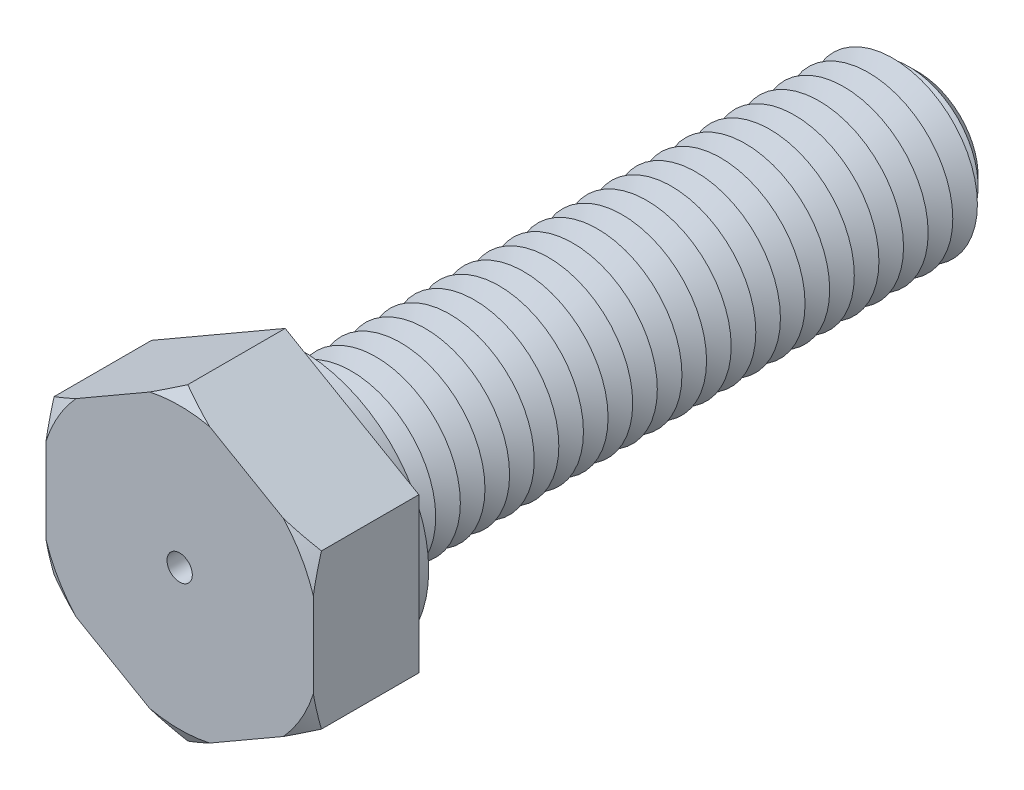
ISO-10303-21;
HEADER;
FILE_DESCRIPTION(('STEP AP214'),'2;1');
FILE_NAME('part.step','',(''),(''),'','','');
FILE_SCHEMA(('AUTOMOTIVE_DESIGN { 1 0 10303 214 1 1 1 1 }'));
ENDSEC;
DATA;
#1=APPLICATION_CONTEXT('core data for automotive mechanical design processes');
#2=APPLICATION_PROTOCOL_DEFINITION('international standard','automotive_design',2000,#1);
#3=PRODUCT_CONTEXT('',#1,'mechanical');
#4=PRODUCT('Part','Part','',(#3));
#5=PRODUCT_RELATED_PRODUCT_CATEGORY('part','',(#4));
#6=PRODUCT_DEFINITION_FORMATION('','',#4);
#7=PRODUCT_DEFINITION_CONTEXT('part definition',#1,'design');
#8=PRODUCT_DEFINITION('design','',#6,#7);
#9=PRODUCT_DEFINITION_SHAPE('','',#8);
#10=(LENGTH_UNIT() NAMED_UNIT(*) SI_UNIT(.MILLI.,.METRE.));
#11=(NAMED_UNIT(*) PLANE_ANGLE_UNIT() SI_UNIT($,.RADIAN.));
#12=(NAMED_UNIT(*) SI_UNIT($,.STERADIAN.) SOLID_ANGLE_UNIT());
#13=UNCERTAINTY_MEASURE_WITH_UNIT(LENGTH_MEASURE(1.E-05),#10,'distance_accuracy_value','');
#14=(GEOMETRIC_REPRESENTATION_CONTEXT(3) GLOBAL_UNCERTAINTY_ASSIGNED_CONTEXT((#13)) GLOBAL_UNIT_ASSIGNED_CONTEXT((#10,
#11,#12)) REPRESENTATION_CONTEXT('',''));
#15=CARTESIAN_POINT('',(0.,0.,0.));
#16=DIRECTION('',(0.,0.,1.));
#17=DIRECTION('',(1.,0.,0.));
#18=AXIS2_PLACEMENT_3D('',#15,#16,#17);
#19=CARTESIAN_POINT('',(9.5,5.48482755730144,7.5));
#20=DIRECTION('',(-0.5,-0.866025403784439,0.));
#21=DIRECTION('',(0.866025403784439,-0.5,0.));
#22=AXIS2_PLACEMENT_3D('',#19,#20,#21);
#23=PLANE('',#22);
#24=CARTESIAN_POINT('',(16.0911028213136,1.67945256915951,3.91531658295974));
#25=CARTESIAN_POINT('',(15.7926530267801,1.85176263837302,4.07633378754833));
#26=CARTESIAN_POINT('',(15.4934885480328,2.02448533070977,4.23561185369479));
#27=CARTESIAN_POINT('',(14.8934288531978,2.37092995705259,4.54987291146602));
#28=CARTESIAN_POINT('',(14.5925334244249,2.54465201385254,4.70485536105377));
#29=CARTESIAN_POINT('',(13.9878148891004,2.89378642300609,5.01015744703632));
#30=CARTESIAN_POINT('',(13.6839854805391,3.06920241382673,5.16046049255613));
#31=CARTESIAN_POINT('',(13.0740489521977,3.4213494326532,5.45475890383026));
#32=CARTESIAN_POINT('',(12.7679419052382,3.59808041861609,5.59875447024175));
#33=CARTESIAN_POINT('',(12.1452865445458,3.95757065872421,5.88261207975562));
#34=CARTESIAN_POINT('',(11.8286703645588,4.14036909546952,6.02227655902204));
#35=CARTESIAN_POINT('',(11.1922429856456,4.50781061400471,6.29164435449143));
#36=CARTESIAN_POINT('',(10.8724316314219,4.69245378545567,6.42134718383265));
#37=CARTESIAN_POINT('',(10.2295404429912,5.06362718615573,6.66831982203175));
#38=CARTESIAN_POINT('',(9.90646410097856,5.25015539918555,6.78560163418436));
#39=CARTESIAN_POINT('',(9.2565183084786,5.62540177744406,7.00502233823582));
#40=CARTESIAN_POINT('',(8.92964935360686,5.81411965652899,7.1071631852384));
#41=CARTESIAN_POINT('',(8.14786487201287,6.26548313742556,7.32807954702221));
#42=CARTESIAN_POINT('',(7.6911273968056,6.52918064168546,7.43861218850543));
#43=CARTESIAN_POINT('',(7.00135730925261,6.92741958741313,7.57140056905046));
#44=CARTESIAN_POINT('',(6.77066782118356,7.06060822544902,7.61016053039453));
#45=CARTESIAN_POINT('',(6.30799755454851,7.3277310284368,7.6757081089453));
#46=CARTESIAN_POINT('',(6.07601678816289,7.46166518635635,7.70249583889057));
#47=CARTESIAN_POINT('',(5.61390562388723,7.72846519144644,7.74308971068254));
#48=CARTESIAN_POINT('',(5.38378495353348,7.86132542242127,7.75704275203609));
#49=CARTESIAN_POINT('',(4.92322735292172,8.1272284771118,7.77208284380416));
#50=CARTESIAN_POINT('',(4.69279042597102,8.26027129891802,7.7731700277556));
#51=CARTESIAN_POINT('',(4.23214422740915,8.52622550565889,7.76244373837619));
#52=CARTESIAN_POINT('',(4.00193495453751,8.65913689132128,7.7506303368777));
#53=CARTESIAN_POINT('',(3.54223236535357,8.92454630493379,7.71446028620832));
#54=CARTESIAN_POINT('',(3.31273916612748,9.05704426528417,7.69010168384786));
#55=CARTESIAN_POINT('',(2.77042202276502,9.37015121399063,7.61833387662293));
#56=CARTESIAN_POINT('',(2.45810922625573,9.55046509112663,7.56573497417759));
#57=CARTESIAN_POINT('',(1.83647686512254,9.90936470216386,7.44074774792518));
#58=CARTESIAN_POINT('',(1.52715774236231,10.087950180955,7.36835654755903));
#59=CARTESIAN_POINT('',(0.911549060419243,10.4433720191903,7.20651778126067));
#60=CARTESIAN_POINT('',(0.605263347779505,10.6202061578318,7.1170509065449));
#61=CARTESIAN_POINT('',(-0.00386858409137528,10.9718886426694,6.92387899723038));
#62=CARTESIAN_POINT('',(-0.30671501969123,11.1467371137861,6.8201748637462));
#63=CARTESIAN_POINT('',(-0.912759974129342,11.496637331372,6.59968787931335));
#64=CARTESIAN_POINT('',(-1.21591973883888,11.6716667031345,6.48276398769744));
#65=CARTESIAN_POINT('',(-1.8190277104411,12.0198712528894,6.23911056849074));
#66=CARTESIAN_POINT('',(-2.11897790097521,12.1930475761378,6.11238754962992));
#67=CARTESIAN_POINT('',(-2.71614501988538,12.5378221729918,5.85087494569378));
#68=CARTESIAN_POINT('',(-3.01336251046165,12.7094207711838,5.71608706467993));
#69=CARTESIAN_POINT('',(-3.60546807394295,13.0512730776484,5.43985672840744));
#70=CARTESIAN_POINT('',(-3.90035610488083,13.2215267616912,5.29841415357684));
#71=CARTESIAN_POINT('',(-4.39671248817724,13.5080982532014,5.05486951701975));
#72=CARTESIAN_POINT('',(-4.59871463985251,13.624724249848,4.95421186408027));
#73=CARTESIAN_POINT('',(-5.00183994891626,13.8574687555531,4.75059724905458));
#74=CARTESIAN_POINT('',(-5.20296313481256,13.9735872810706,4.647640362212));
#75=CARTESIAN_POINT('',(-5.60231741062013,14.2041545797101,4.44078592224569));
#76=CARTESIAN_POINT('',(-5.80055672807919,14.3186081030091,4.33690951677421));
#77=CARTESIAN_POINT('',(-6.19633679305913,14.5471118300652,4.12738601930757));
#78=CARTESIAN_POINT('',(-6.39387752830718,14.6611620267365,4.02173889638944));
#79=CARTESIAN_POINT('',(-6.59110282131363,14.7750301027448,3.91531658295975));
#80=B_SPLINE_CURVE_WITH_KNOTS('',3,(#24,#25,#26,#27,#28,#29,#30,#31,#32,#33,#34,#35,#36,#37,#38,
#39,#40,#41,#42,#43,#44,#45,#46,#47,#48,#49,#50,#51,#52,#53,#54,#55,#56,#57,#58,#59,#60,#61,#62,
#63,#64,#65,#66,#67,#68,#69,#70,#71,#72,#73,#74,#75,#76,#77,#78,#79),.UNSPECIFIED.,.F.,.F.,(4,2,
2,2,2,2,2,2,2,2,2,2,2,2,2,2,2,2,2,2,2,2,2,2,2,2,2,4),(0.,1.14115474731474,2.28245284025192,
3.42741980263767,4.57235031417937,5.74632926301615,6.92036555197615,8.09325673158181,
9.26599632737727,10.8807998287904,11.6881240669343,12.4954407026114,13.2933978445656,
14.0913467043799,14.8892911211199,15.6873598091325,16.7800286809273,17.8728564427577,
18.9669273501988,20.0609290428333,21.1679585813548,22.2742590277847,23.380326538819,
24.4864139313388,25.2485345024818,26.010630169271,26.7647435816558,27.5188701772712),.UNSPECIFIED.);
#81=CARTESIAN_POINT('',(9.5,5.48482755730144,6.92264973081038));
#82=VERTEX_POINT('',#81);
#83=CARTESIAN_POINT('',(7.36878164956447,6.71528704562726,7.5));
#84=VERTEX_POINT('',#83);
#85=EDGE_CURVE('E132',#82,#84,#80,.T.);
#86=ORIENTED_EDGE('',*,*,#85,.F.);
#87=DIRECTION('',(0.,0.,-1.));
#88=VECTOR('',#87,1.);
#89=CARTESIAN_POINT('',(9.5,5.48482755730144,7.5));
#90=LINE('',#89,#88);
#91=CARTESIAN_POINT('',(9.5,5.48482755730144,0.));
#92=VERTEX_POINT('',#91);
#93=EDGE_CURVE('E144',#82,#92,#90,.T.);
#94=ORIENTED_EDGE('',*,*,#93,.T.);
#95=DIRECTION('',(-0.866025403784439,0.5,0.));
#96=VECTOR('',#95,1.);
#97=CARTESIAN_POINT('',(9.5,5.48482755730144,0.));
#98=LINE('',#97,#96);
#99=CARTESIAN_POINT('',(0.,10.9696551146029,0.));
#100=VERTEX_POINT('',#99);
#101=EDGE_CURVE('E402',#92,#100,#98,.T.);
#102=ORIENTED_EDGE('',*,*,#101,.T.);
#103=DIRECTION('',(0.,0.,-1.));
#104=VECTOR('',#103,1.);
#105=CARTESIAN_POINT('',(0.,10.9696551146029,7.5));
#106=LINE('',#105,#104);
#107=CARTESIAN_POINT('',(0.,10.9696551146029,6.92264973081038));
#108=VERTEX_POINT('',#107);
#109=EDGE_CURVE('E179',#108,#100,#106,.T.);
#110=ORIENTED_EDGE('',*,*,#109,.F.);
#111=CARTESIAN_POINT('',(2.13121835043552,9.73919562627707,7.5));
#112=VERTEX_POINT('',#111);
#113=EDGE_CURVE('E151',#112,#108,#80,.T.);
#114=ORIENTED_EDGE('',*,*,#113,.F.);
#115=DIRECTION('',(-0.866025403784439,0.5,0.));
#116=VECTOR('',#115,1.);
#117=CARTESIAN_POINT('',(9.5,5.48482755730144,7.5));
#118=LINE('',#117,#116);
#119=EDGE_CURVE('E148',#84,#112,#118,.T.);
#120=ORIENTED_EDGE('',*,*,#119,.F.);
#121=EDGE_LOOP('',(#86,#94,#102,#110,#114,#120));
#122=FACE_BOUND('',#121,.T.);
#123=ADVANCED_FACE('F39',(#122),#23,.F.);
#124=CARTESIAN_POINT('',(0.,10.9696551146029,7.5));
#125=DIRECTION('',(0.5,-0.866025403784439,0.));
#126=DIRECTION('',(0.866025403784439,0.5,0.));
#127=AXIS2_PLACEMENT_3D('',#124,#125,#126);
#128=PLANE('',#127);
#129=CARTESIAN_POINT('',(6.59110282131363,14.7750301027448,3.91531658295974));
#130=CARTESIAN_POINT('',(6.29265302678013,14.6027200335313,4.07633378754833));
#131=CARTESIAN_POINT('',(5.99348854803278,14.4299973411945,4.23561185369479));
#132=CARTESIAN_POINT('',(5.3934288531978,14.0835527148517,4.54987291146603));
#133=CARTESIAN_POINT('',(5.09253342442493,13.9098306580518,4.70485536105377));
#134=CARTESIAN_POINT('',(4.48781488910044,13.5606962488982,5.01015744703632));
#135=CARTESIAN_POINT('',(4.18398548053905,13.3852802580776,5.16046049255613));
#136=CARTESIAN_POINT('',(3.5740489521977,13.0331332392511,5.45475890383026));
#137=CARTESIAN_POINT('',(3.26794190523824,12.8564022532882,5.59875447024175));
#138=CARTESIAN_POINT('',(2.64528654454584,12.4969120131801,5.88261207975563));
#139=CARTESIAN_POINT('',(2.32867036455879,12.3141135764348,6.02227655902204));
#140=CARTESIAN_POINT('',(1.69224298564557,11.9466720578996,6.29164435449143));
#141=CARTESIAN_POINT('',(1.37243163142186,11.7620288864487,6.42134718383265));
#142=CARTESIAN_POINT('',(0.729540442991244,11.3908554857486,6.66831982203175));
#143=CARTESIAN_POINT('',(0.406464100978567,11.2043272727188,6.78560163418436));
#144=CARTESIAN_POINT('',(-0.243481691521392,10.8290808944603,7.00502233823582));
#145=CARTESIAN_POINT('',(-0.570350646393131,10.6403630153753,7.1071631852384));
#146=CARTESIAN_POINT('',(-1.35213512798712,10.1889995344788,7.32807954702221));
#147=CARTESIAN_POINT('',(-1.80887260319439,9.92530203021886,7.43861218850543));
#148=CARTESIAN_POINT('',(-2.49864269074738,9.52706308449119,7.57140056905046));
#149=CARTESIAN_POINT('',(-2.72933217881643,9.39387444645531,7.61016053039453));
#150=CARTESIAN_POINT('',(-3.19200244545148,9.12675164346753,7.6757081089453));
#151=CARTESIAN_POINT('',(-3.4239832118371,8.99281748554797,7.70249583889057));
#152=CARTESIAN_POINT('',(-3.88609437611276,8.72601748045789,7.74308971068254));
#153=CARTESIAN_POINT('',(-4.11621504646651,8.59315724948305,7.75704275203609));
#154=CARTESIAN_POINT('',(-4.57677264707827,8.32725419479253,7.77208284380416));
#155=CARTESIAN_POINT('',(-4.80720957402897,8.19421137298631,7.7731700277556));
#156=CARTESIAN_POINT('',(-5.26785577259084,7.92825716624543,7.76244373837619));
#157=CARTESIAN_POINT('',(-5.49806504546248,7.79534578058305,7.7506303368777));
#158=CARTESIAN_POINT('',(-5.95776763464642,7.52993636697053,7.71446028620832));
#159=CARTESIAN_POINT('',(-6.18726083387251,7.39743840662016,7.69010168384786));
#160=CARTESIAN_POINT('',(-6.72957797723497,7.0843314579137,7.61833387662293));
#161=CARTESIAN_POINT('',(-7.04189077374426,6.90401758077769,7.56573497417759));
#162=CARTESIAN_POINT('',(-7.66352313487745,6.54511796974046,7.44074774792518));
#163=CARTESIAN_POINT('',(-7.97284225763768,6.36653249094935,7.36835654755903));
#164=CARTESIAN_POINT('',(-8.58845093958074,6.01111065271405,7.20651778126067));
#165=CARTESIAN_POINT('',(-8.89473665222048,5.83427651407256,7.1170509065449));
#166=CARTESIAN_POINT('',(-9.50386858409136,5.48259402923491,6.92387899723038));
#167=CARTESIAN_POINT('',(-9.80671501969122,5.30774555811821,6.8201748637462));
#168=CARTESIAN_POINT('',(-10.4127599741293,4.95784534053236,6.59968787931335));
#169=CARTESIAN_POINT('',(-10.7159197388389,4.78281596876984,6.48276398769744));
#170=CARTESIAN_POINT('',(-11.3190277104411,4.43461141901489,6.23911056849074));
#171=CARTESIAN_POINT('',(-11.6189779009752,4.26143509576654,6.11238754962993));
#172=CARTESIAN_POINT('',(-12.2161450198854,3.91666049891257,5.85087494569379));
#173=CARTESIAN_POINT('',(-12.5133625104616,3.74506190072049,5.71608706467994));
#174=CARTESIAN_POINT('',(-13.1054680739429,3.40320959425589,5.43985672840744));
#175=CARTESIAN_POINT('',(-13.4003561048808,3.2329559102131,5.29841415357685));
#176=CARTESIAN_POINT('',(-13.8967124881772,2.94638441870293,5.05486951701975));
#177=CARTESIAN_POINT('',(-14.0987146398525,2.82975842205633,4.95421186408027));
#178=CARTESIAN_POINT('',(-14.5018399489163,2.59701391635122,4.75059724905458));
#179=CARTESIAN_POINT('',(-14.7029631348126,2.48089539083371,4.647640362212));
#180=CARTESIAN_POINT('',(-15.1023174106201,2.25032809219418,4.44078592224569));
#181=CARTESIAN_POINT('',(-15.3005567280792,2.13587456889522,4.33690951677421));
#182=CARTESIAN_POINT('',(-15.6963367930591,1.90737084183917,4.12738601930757));
#183=CARTESIAN_POINT('',(-15.8938775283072,1.79332064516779,4.02173889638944));
#184=CARTESIAN_POINT('',(-16.0911028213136,1.67945256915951,3.91531658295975));
#185=B_SPLINE_CURVE_WITH_KNOTS('',3,(#129,#130,#131,#132,#133,#134,#135,#136,#137,#138,#139,
#140,#141,#142,#143,#144,#145,#146,#147,#148,#149,#150,#151,#152,#153,#154,#155,#156,#157,#158,
#159,#160,#161,#162,#163,#164,#165,#166,#167,#168,#169,#170,#171,#172,#173,#174,#175,#176,#177,
#178,#179,#180,#181,#182,#183,#184),.UNSPECIFIED.,.F.,.F.,(4,2,2,2,2,2,2,2,2,2,2,2,2,2,2,2,2,2,
2,2,2,2,2,2,2,2,2,4),(0.,1.14115474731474,2.28245284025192,3.42741980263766,4.57235031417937,
5.74632926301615,6.92036555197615,8.09325673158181,9.26599632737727,10.8807998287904,
11.6881240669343,12.4954407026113,13.2933978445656,14.0913467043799,14.8892911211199,
15.6873598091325,16.7800286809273,17.8728564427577,18.9669273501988,20.0609290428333,
21.1679585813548,22.2742590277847,23.380326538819,24.4864139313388,25.2485345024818,
26.010630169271,26.7647435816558,27.5188701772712),.UNSPECIFIED.);
#186=CARTESIAN_POINT('',(-2.13121835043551,9.73919562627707,7.5));
#187=VERTEX_POINT('',#186);
#188=EDGE_CURVE('E1238',#108,#187,#185,.T.);
#189=ORIENTED_EDGE('',*,*,#188,.F.);
#190=ORIENTED_EDGE('',*,*,#109,.T.);
#191=DIRECTION('',(-0.866025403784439,-0.5,0.));
#192=VECTOR('',#191,1.);
#193=CARTESIAN_POINT('',(0.,10.9696551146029,0.));
#194=LINE('',#193,#192);
#195=CARTESIAN_POINT('',(-9.5,5.48482755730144,0.));
#196=VERTEX_POINT('',#195);
#197=EDGE_CURVE('E422',#100,#196,#194,.T.);
#198=ORIENTED_EDGE('',*,*,#197,.T.);
#199=DIRECTION('',(0.,0.,-1.));
#200=VECTOR('',#199,1.);
#201=CARTESIAN_POINT('',(-9.5,5.48482755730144,7.5));
#202=LINE('',#201,#200);
#203=CARTESIAN_POINT('',(-9.5,5.48482755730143,6.92264973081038));
#204=VERTEX_POINT('',#203);
#205=EDGE_CURVE('E176',#204,#196,#202,.T.);
#206=ORIENTED_EDGE('',*,*,#205,.F.);
#207=CARTESIAN_POINT('',(-7.36878164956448,6.71528704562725,7.5));
#208=VERTEX_POINT('',#207);
#209=EDGE_CURVE('E495',#208,#204,#185,.T.);
#210=ORIENTED_EDGE('',*,*,#209,.F.);
#211=DIRECTION('',(-0.866025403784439,-0.5,0.));
#212=VECTOR('',#211,1.);
#213=CARTESIAN_POINT('',(0.,10.9696551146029,7.5));
#214=LINE('',#213,#212);
#215=EDGE_CURVE('E405',#187,#208,#214,.T.);
#216=ORIENTED_EDGE('',*,*,#215,.F.);
#217=EDGE_LOOP('',(#189,#190,#198,#206,#210,#216));
#218=FACE_BOUND('',#217,.T.);
#219=ADVANCED_FACE('F504',(#218),#128,.F.);
#220=CARTESIAN_POINT('',(-9.5,5.48482755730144,7.5));
#221=DIRECTION('',(1.,0.,0.));
#222=DIRECTION('',(0.,1.,0.));
#223=AXIS2_PLACEMENT_3D('',#220,#221,#222);
#224=PLANE('',#223);
#225=CARTESIAN_POINT('',(-9.5,12.0759303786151,4.38509256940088));
#226=CARTESIAN_POINT('',(-9.5,11.7327439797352,4.5407773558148));
#227=CARTESIAN_POINT('',(-9.5,11.388618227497,4.69443095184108));
#228=CARTESIAN_POINT('',(-9.5,10.698085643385,4.99669009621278));
#229=CARTESIAN_POINT('',(-9.5,10.3516784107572,5.1452947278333));
#230=CARTESIAN_POINT('',(-9.5,9.65484997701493,5.43702212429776));
#231=CARTESIAN_POINT('',(-9.5,9.30441804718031,5.58011936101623));
#232=CARTESIAN_POINT('',(-9.5,8.60059023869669,5.85880989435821));
#233=CARTESIAN_POINT('',(-9.5,8.24719449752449,5.9944035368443));
#234=CARTESIAN_POINT('',(-9.5,7.53860340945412,6.25582574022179));
#235=CARTESIAN_POINT('',(-9.5,7.18342337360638,6.38169559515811));
#236=CARTESIAN_POINT('',(-9.5,6.46926569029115,6.62229858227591));
#237=CARTESIAN_POINT('',(-9.5,6.11028785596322,6.73703116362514));
#238=CARTESIAN_POINT('',(-9.5,5.38872372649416,6.95272419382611));
#239=CARTESIAN_POINT('',(-9.5,5.02614305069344,7.05370330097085));
#240=CARTESIAN_POINT('',(-9.5,4.29675196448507,7.23920160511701));
#241=CARTESIAN_POINT('',(-9.5,3.92994173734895,7.32372151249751));
#242=CARTESIAN_POINT('',(-9.5,3.29665308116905,7.45205940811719));
#243=CARTESIAN_POINT('',(-9.5,3.03113701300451,7.50062833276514));
#244=CARTESIAN_POINT('',(-9.5,2.49832809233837,7.5865841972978));
#245=CARTESIAN_POINT('',(-9.5,2.23103554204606,7.62397299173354));
#246=CARTESIAN_POINT('',(-9.5,1.69506861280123,7.68659004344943));
#247=CARTESIAN_POINT('',(-9.5,1.42639449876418,7.71182055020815));
#248=CARTESIAN_POINT('',(-9.5,0.888138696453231,7.74939803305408));
#249=CARTESIAN_POINT('',(-9.5,0.618557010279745,7.76174503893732));
#250=CARTESIAN_POINT('',(-9.5,0.0792458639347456,7.77317034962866));
#251=CARTESIAN_POINT('',(-9.5,-0.190483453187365,7.77225534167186));
#252=CARTESIAN_POINT('',(-9.5,-0.729567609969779,7.75720205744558));
#253=CARTESIAN_POINT('',(-9.5,-0.998922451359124,7.74306384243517));
#254=CARTESIAN_POINT('',(-9.5,-1.53667618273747,7.70199575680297));
#255=CARTESIAN_POINT('',(-9.5,-1.80507496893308,7.67506453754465));
#256=CARTESIAN_POINT('',(-9.5,-2.34038611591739,7.60918517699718));
#257=CARTESIAN_POINT('',(-9.5,-2.60729841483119,7.57023653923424));
#258=CARTESIAN_POINT('',(-9.5,-3.27166409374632,7.45918941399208));
#259=CARTESIAN_POINT('',(-9.5,-3.66797754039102,7.38023980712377));
#260=CARTESIAN_POINT('',(-9.5,-4.45585575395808,7.20141943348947));
#261=CARTESIAN_POINT('',(-9.5,-4.8474194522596,7.10154404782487));
#262=CARTESIAN_POINT('',(-9.5,-5.6265713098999,6.88438943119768));
#263=CARTESIAN_POINT('',(-9.5,-6.01414884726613,6.76707245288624));
#264=CARTESIAN_POINT('',(-9.5,-6.78474185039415,6.51851091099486));
#265=CARTESIAN_POINT('',(-9.5,-7.16775763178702,6.38726731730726));
#266=CARTESIAN_POINT('',(-9.5,-7.93407213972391,6.11202298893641));
#267=CARTESIAN_POINT('',(-9.5,-8.31732458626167,5.96789419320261));
#268=CARTESIAN_POINT('',(-9.5,-9.08024927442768,5.67043108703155));
#269=CARTESIAN_POINT('',(-9.5,-9.4599212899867,5.51709619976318));
#270=CARTESIAN_POINT('',(-9.5,-10.2138362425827,5.20397874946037));
#271=CARTESIAN_POINT('',(-9.5,-10.5880982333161,5.04424191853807));
#272=CARTESIAN_POINT('',(-9.5,-11.1474871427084,4.80018423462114));
#273=CARTESIAN_POINT('',(-9.5,-11.3335947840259,4.71809930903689));
#274=CARTESIAN_POINT('',(-9.5,-11.7052038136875,4.55257683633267));
#275=CARTESIAN_POINT('',(-9.5,-11.8907052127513,4.46913931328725));
#276=CARTESIAN_POINT('',(-9.5,-12.0759303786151,4.38509256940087));
#277=B_SPLINE_CURVE_WITH_KNOTS('',3,(#225,#226,#227,#228,#229,#230,#231,#232,#233,#234,#235,
#236,#237,#238,#239,#240,#241,#242,#243,#244,#245,#246,#247,#248,#249,#250,#251,#252,#253,#254,
#255,#256,#257,#258,#259,#260,#261,#262,#263,#264,#265,#266,#267,#268,#269,#270,#271,#272,#273,
#274,#275,#276),.UNSPECIFIED.,.F.,.F.,(4,2,2,2,2,2,2,2,2,2,2,2,2,2,2,2,2,2,2,2,2,2,2,2,2,4),(0.,
1.13056270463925,2.26132959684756,3.39682602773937,4.53227007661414,5.66259174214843,
6.79296928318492,7.92179771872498,9.0505774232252,9.86013572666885,10.6695596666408,
11.4788337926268,12.288106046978,13.0969702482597,13.9058307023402,14.7147764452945,
15.5237556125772,16.7353316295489,17.9471753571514,19.1616810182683,20.3761021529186,
21.6043286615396,22.8326322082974,24.0533405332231,24.6635541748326,25.273756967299),.UNSPECIFIED.);
#278=CARTESIAN_POINT('',(-9.5,3.02390858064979,7.5));
#279=VERTEX_POINT('',#278);
#280=EDGE_CURVE('E443',#204,#279,#277,.T.);
#281=ORIENTED_EDGE('',*,*,#280,.F.);
#282=ORIENTED_EDGE('',*,*,#205,.T.);
#283=DIRECTION('',(0.,-1.,0.));
#284=VECTOR('',#283,1.);
#285=CARTESIAN_POINT('',(-9.5,5.48482755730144,0.));
#286=LINE('',#285,#284);
#287=CARTESIAN_POINT('',(-9.5,-5.48482755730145,0.));
#288=VERTEX_POINT('',#287);
#289=EDGE_CURVE('E426',#196,#288,#286,.T.);
#290=ORIENTED_EDGE('',*,*,#289,.T.);
#291=DIRECTION('',(0.,0.,-1.));
#292=VECTOR('',#291,1.);
#293=CARTESIAN_POINT('',(-9.5,-5.48482755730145,7.5));
#294=LINE('',#293,#292);
#295=CARTESIAN_POINT('',(-9.49999999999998,-5.48482755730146,6.92264973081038));
#296=VERTEX_POINT('',#295);
#297=EDGE_CURVE('E173',#296,#288,#294,.T.);
#298=ORIENTED_EDGE('',*,*,#297,.F.);
#299=CARTESIAN_POINT('',(-9.5,-3.02390858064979,7.5));
#300=VERTEX_POINT('',#299);
#301=EDGE_CURVE('E442',#300,#296,#277,.T.);
#302=ORIENTED_EDGE('',*,*,#301,.F.);
#303=DIRECTION('',(0.,-1.,0.));
#304=VECTOR('',#303,1.);
#305=CARTESIAN_POINT('',(-9.5,5.48482755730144,7.5));
#306=LINE('',#305,#304);
#307=EDGE_CURVE('E409',#279,#300,#306,.T.);
#308=ORIENTED_EDGE('',*,*,#307,.F.);
#309=EDGE_LOOP('',(#281,#282,#290,#298,#302,#308));
#310=FACE_BOUND('',#309,.T.);
#311=ADVANCED_FACE('F500',(#310),#224,.F.);
#312=CARTESIAN_POINT('',(-9.5,-5.48482755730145,7.5));
#313=DIRECTION('',(0.5,0.866025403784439,0.));
#314=DIRECTION('',(-0.866025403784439,0.5,0.));
#315=AXIS2_PLACEMENT_3D('',#312,#313,#314);
#316=PLANE('',#315);
#317=CARTESIAN_POINT('',(-16.0911028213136,-1.67945256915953,3.91531658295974));
#318=CARTESIAN_POINT('',(-15.7926530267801,-1.85176263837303,4.07633378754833));
#319=CARTESIAN_POINT('',(-15.4934885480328,-2.02448533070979,4.23561185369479));
#320=CARTESIAN_POINT('',(-14.8934288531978,-2.37092995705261,4.54987291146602));
#321=CARTESIAN_POINT('',(-14.5925334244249,-2.54465201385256,4.70485536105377));
#322=CARTESIAN_POINT('',(-13.9878148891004,-2.89378642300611,5.01015744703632));
#323=CARTESIAN_POINT('',(-13.683985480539,-3.06920241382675,5.16046049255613));
#324=CARTESIAN_POINT('',(-13.0740489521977,-3.42134943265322,5.45475890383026));
#325=CARTESIAN_POINT('',(-12.7679419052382,-3.5980804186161,5.59875447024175));
#326=CARTESIAN_POINT('',(-12.1452865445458,-3.95757065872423,5.88261207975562));
#327=CARTESIAN_POINT('',(-11.8286703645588,-4.14036909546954,6.02227655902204));
#328=CARTESIAN_POINT('',(-11.1922429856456,-4.50781061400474,6.29164435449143));
#329=CARTESIAN_POINT('',(-10.8724316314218,-4.69245378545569,6.42134718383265));
#330=CARTESIAN_POINT('',(-10.2295404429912,-5.06362718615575,6.66831982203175));
#331=CARTESIAN_POINT('',(-9.90646410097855,-5.25015539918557,6.78560163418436));
#332=CARTESIAN_POINT('',(-9.25651830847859,-5.62540177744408,7.00502233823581));
#333=CARTESIAN_POINT('',(-8.92964935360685,-5.81411965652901,7.1071631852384));
#334=CARTESIAN_POINT('',(-8.14786487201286,-6.26548313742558,7.32807954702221));
#335=CARTESIAN_POINT('',(-7.69112739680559,-6.52918064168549,7.43861218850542));
#336=CARTESIAN_POINT('',(-7.0013573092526,-6.92741958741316,7.57140056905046));
#337=CARTESIAN_POINT('',(-6.77066782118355,-7.06060822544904,7.61016053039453));
#338=CARTESIAN_POINT('',(-6.3079975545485,-7.32773102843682,7.6757081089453));
#339=CARTESIAN_POINT('',(-6.07601678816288,-7.46166518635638,7.70249583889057));
#340=CARTESIAN_POINT('',(-5.61390562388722,-7.72846519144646,7.74308971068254));
#341=CARTESIAN_POINT('',(-5.38378495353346,-7.8613254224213,7.75704275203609));
#342=CARTESIAN_POINT('',(-4.9232273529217,-8.12722847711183,7.77208284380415));
#343=CARTESIAN_POINT('',(-4.692790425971,-8.26027129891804,7.77317002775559));
#344=CARTESIAN_POINT('',(-4.23214422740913,-8.52622550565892,7.76244373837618));
#345=CARTESIAN_POINT('',(-4.00193495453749,-8.6591368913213,7.75063033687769));
#346=CARTESIAN_POINT('',(-3.54223236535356,-8.92454630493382,7.71446028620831));
#347=CARTESIAN_POINT('',(-3.31273916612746,-9.05704426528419,7.69010168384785));
#348=CARTESIAN_POINT('',(-2.770422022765,-9.37015121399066,7.61833387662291));
#349=CARTESIAN_POINT('',(-2.45810922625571,-9.55046509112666,7.56573497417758));
#350=CARTESIAN_POINT('',(-1.83647686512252,-9.9093647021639,7.44074774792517));
#351=CARTESIAN_POINT('',(-1.52715774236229,-10.087950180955,7.36835654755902));
#352=CARTESIAN_POINT('',(-0.911549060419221,-10.4433720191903,7.20651778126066));
#353=CARTESIAN_POINT('',(-0.605263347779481,-10.6202061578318,7.11705090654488));
#354=CARTESIAN_POINT('',(0.00386858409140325,-10.9718886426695,6.92387899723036));
#355=CARTESIAN_POINT('',(0.30671501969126,-11.1467371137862,6.82017486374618));
#356=CARTESIAN_POINT('',(0.912759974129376,-11.496637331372,6.59968787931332));
#357=CARTESIAN_POINT('',(1.21591973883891,-11.6716667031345,6.48276398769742));
#358=CARTESIAN_POINT('',(1.81902771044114,-12.0198712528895,6.23911056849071));
#359=CARTESIAN_POINT('',(2.11897790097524,-12.1930475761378,6.11238754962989));
#360=CARTESIAN_POINT('',(2.71614501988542,-12.5378221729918,5.85087494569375));
#361=CARTESIAN_POINT('',(3.01336251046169,-12.7094207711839,5.7160870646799));
#362=CARTESIAN_POINT('',(3.60546807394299,-13.0512730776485,5.4398567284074));
#363=CARTESIAN_POINT('',(3.90035610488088,-13.2215267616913,5.29841415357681));
#364=CARTESIAN_POINT('',(4.39671248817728,-13.5080982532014,5.05486951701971));
#365=CARTESIAN_POINT('',(4.59871463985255,-13.624724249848,4.95421186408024));
#366=CARTESIAN_POINT('',(5.00183994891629,-13.8574687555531,4.75059724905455));
#367=CARTESIAN_POINT('',(5.20296313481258,-13.9735872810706,4.64764036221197));
#368=CARTESIAN_POINT('',(5.60231741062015,-14.2041545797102,4.44078592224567));
#369=CARTESIAN_POINT('',(5.8005567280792,-14.3186081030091,4.33690951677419));
#370=CARTESIAN_POINT('',(6.19633679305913,-14.5471118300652,4.12738601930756));
#371=CARTESIAN_POINT('',(6.39387752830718,-14.6611620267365,4.02173889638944));
#372=CARTESIAN_POINT('',(6.59110282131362,-14.7750301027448,3.91531658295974));
#373=B_SPLINE_CURVE_WITH_KNOTS('',3,(#317,#318,#319,#320,#321,#322,#323,#324,#325,#326,#327,
#328,#329,#330,#331,#332,#333,#334,#335,#336,#337,#338,#339,#340,#341,#342,#343,#344,#345,#346,
#347,#348,#349,#350,#351,#352,#353,#354,#355,#356,#357,#358,#359,#360,#361,#362,#363,#364,#365,
#366,#367,#368,#369,#370,#371,#372),.UNSPECIFIED.,.F.,.F.,(4,2,2,2,2,2,2,2,2,2,2,2,2,2,2,2,2,2,
2,2,2,2,2,2,2,2,2,4),(0.,1.14115474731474,2.28245284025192,3.42741980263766,4.57235031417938,
5.74632926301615,6.92036555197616,8.09325673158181,9.26599632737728,10.8807998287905,
11.6881240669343,12.4954407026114,13.2933978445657,14.0913467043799,14.8892911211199,
15.6873598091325,16.7800286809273,17.8728564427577,18.9669273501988,20.0609290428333,
21.1679585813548,22.2742590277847,23.3803265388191,24.4864139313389,25.2485345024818,
26.010630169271,26.7647435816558,27.5188701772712),.UNSPECIFIED.);
#374=CARTESIAN_POINT('',(-7.36878164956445,-6.71528704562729,7.5));
#375=VERTEX_POINT('',#374);
#376=EDGE_CURVE('E444',#296,#375,#373,.T.);
#377=ORIENTED_EDGE('',*,*,#376,.F.);
#378=ORIENTED_EDGE('',*,*,#297,.T.);
#379=DIRECTION('',(0.866025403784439,-0.5,0.));
#380=VECTOR('',#379,1.);
#381=CARTESIAN_POINT('',(-9.5,-5.48482755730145,0.));
#382=LINE('',#381,#380);
#383=CARTESIAN_POINT('',(0.,-10.9696551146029,0.));
#384=VERTEX_POINT('',#383);
#385=EDGE_CURVE('E430',#288,#384,#382,.T.);
#386=ORIENTED_EDGE('',*,*,#385,.T.);
#387=DIRECTION('',(0.,0.,-1.));
#388=VECTOR('',#387,1.);
#389=CARTESIAN_POINT('',(0.,-10.9696551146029,7.5));
#390=LINE('',#389,#388);
#391=CARTESIAN_POINT('',(0.,-10.9696551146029,6.92264973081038));
#392=VERTEX_POINT('',#391);
#393=EDGE_CURVE('E163',#392,#384,#390,.T.);
#394=ORIENTED_EDGE('',*,*,#393,.F.);
#395=CARTESIAN_POINT('',(-2.13121835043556,-9.73919562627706,7.5));
#396=VERTEX_POINT('',#395);
#397=EDGE_CURVE('E447',#396,#392,#373,.T.);
#398=ORIENTED_EDGE('',*,*,#397,.F.);
#399=DIRECTION('',(0.866025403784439,-0.5,0.));
#400=VECTOR('',#399,1.);
#401=CARTESIAN_POINT('',(-9.5,-5.48482755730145,7.5));
#402=LINE('',#401,#400);
#403=EDGE_CURVE('E413',#375,#396,#402,.T.);
#404=ORIENTED_EDGE('',*,*,#403,.F.);
#405=EDGE_LOOP('',(#377,#378,#386,#394,#398,#404));
#406=FACE_BOUND('',#405,.T.);
#407=ADVANCED_FACE('F503',(#406),#316,.F.);
#408=CARTESIAN_POINT('',(0.,-10.9696551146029,7.5));
#409=DIRECTION('',(-0.5,0.866025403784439,0.));
#410=DIRECTION('',(-0.866025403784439,-0.5,0.));
#411=AXIS2_PLACEMENT_3D('',#408,#409,#410);
#412=PLANE('',#411);
#413=CARTESIAN_POINT('',(-6.59110282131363,-14.7750301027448,3.91531658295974));
#414=CARTESIAN_POINT('',(-6.29265302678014,-14.6027200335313,4.07633378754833));
#415=CARTESIAN_POINT('',(-5.99348854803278,-14.4299973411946,4.23561185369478));
#416=CARTESIAN_POINT('',(-5.3934288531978,-14.0835527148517,4.54987291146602));
#417=CARTESIAN_POINT('',(-5.09253342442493,-13.9098306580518,4.70485536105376));
#418=CARTESIAN_POINT('',(-4.48781488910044,-13.5606962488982,5.01015744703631));
#419=CARTESIAN_POINT('',(-4.18398548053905,-13.3852802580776,5.16046049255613));
#420=CARTESIAN_POINT('',(-3.5740489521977,-13.0331332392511,5.45475890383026));
#421=CARTESIAN_POINT('',(-3.26794190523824,-12.8564022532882,5.59875447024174));
#422=CARTESIAN_POINT('',(-2.64528654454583,-12.4969120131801,5.88261207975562));
#423=CARTESIAN_POINT('',(-2.32867036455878,-12.3141135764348,6.02227655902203));
#424=CARTESIAN_POINT('',(-1.69224298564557,-11.9466720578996,6.29164435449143));
#425=CARTESIAN_POINT('',(-1.37243163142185,-11.7620288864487,6.42134718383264));
#426=CARTESIAN_POINT('',(-0.729540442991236,-11.3908554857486,6.66831982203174));
#427=CARTESIAN_POINT('',(-0.406464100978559,-11.2043272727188,6.78560163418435));
#428=CARTESIAN_POINT('',(0.243481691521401,-10.8290808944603,7.00502233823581));
#429=CARTESIAN_POINT('',(0.570350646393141,-10.6403630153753,7.10716318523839));
#430=CARTESIAN_POINT('',(1.35213512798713,-10.1889995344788,7.3280795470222));
#431=CARTESIAN_POINT('',(1.8088726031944,-9.92530203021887,7.43861218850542));
#432=CARTESIAN_POINT('',(2.49864269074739,-9.5270630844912,7.57140056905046));
#433=CARTESIAN_POINT('',(2.72933217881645,-9.39387444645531,7.61016053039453));
#434=CARTESIAN_POINT('',(3.19200244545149,-9.12675164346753,7.6757081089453));
#435=CARTESIAN_POINT('',(3.42398321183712,-8.99281748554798,7.70249583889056));
#436=CARTESIAN_POINT('',(3.88609437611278,-8.72601748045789,7.74308971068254));
#437=CARTESIAN_POINT('',(4.11621504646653,-8.59315724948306,7.75704275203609));
#438=CARTESIAN_POINT('',(4.57677264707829,-8.32725419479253,7.77208284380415));
#439=CARTESIAN_POINT('',(4.80720957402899,-8.19421137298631,7.77317002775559));
#440=CARTESIAN_POINT('',(5.26785577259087,-7.92825716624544,7.76244373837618));
#441=CARTESIAN_POINT('',(5.4980650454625,-7.79534578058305,7.75063033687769));
#442=CARTESIAN_POINT('',(5.95776763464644,-7.52993636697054,7.71446028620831));
#443=CARTESIAN_POINT('',(6.18726083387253,-7.39743840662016,7.69010168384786));
#444=CARTESIAN_POINT('',(6.72957797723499,-7.0843314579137,7.61833387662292));
#445=CARTESIAN_POINT('',(7.04189077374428,-6.9040175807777,7.56573497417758));
#446=CARTESIAN_POINT('',(7.66352313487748,-6.54511796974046,7.44074774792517));
#447=CARTESIAN_POINT('',(7.97284225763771,-6.36653249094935,7.36835654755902));
#448=CARTESIAN_POINT('',(8.58845093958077,-6.01111065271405,7.20651778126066));
#449=CARTESIAN_POINT('',(8.89473665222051,-5.83427651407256,7.11705090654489));
#450=CARTESIAN_POINT('',(9.50386858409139,-5.48259402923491,6.92387899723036));
#451=CARTESIAN_POINT('',(9.80671501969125,-5.30774555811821,6.82017486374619));
#452=CARTESIAN_POINT('',(10.4127599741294,-4.95784534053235,6.59968787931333));
#453=CARTESIAN_POINT('',(10.7159197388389,-4.78281596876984,6.48276398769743));
#454=CARTESIAN_POINT('',(11.3190277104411,-4.43461141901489,6.23911056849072));
#455=CARTESIAN_POINT('',(11.6189779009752,-4.26143509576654,6.1123875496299));
#456=CARTESIAN_POINT('',(12.2161450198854,-3.91666049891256,5.85087494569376));
#457=CARTESIAN_POINT('',(12.5133625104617,-3.74506190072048,5.71608706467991));
#458=CARTESIAN_POINT('',(13.105468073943,-3.40320959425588,5.43985672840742));
#459=CARTESIAN_POINT('',(13.4003561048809,-3.23295591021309,5.29841415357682));
#460=CARTESIAN_POINT('',(13.8967124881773,-2.94638441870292,5.05486951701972));
#461=CARTESIAN_POINT('',(14.0987146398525,-2.82975842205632,4.95421186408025));
#462=CARTESIAN_POINT('',(14.5018399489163,-2.59701391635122,4.75059724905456));
#463=CARTESIAN_POINT('',(14.7029631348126,-2.48089539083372,4.64764036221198));
#464=CARTESIAN_POINT('',(15.1023174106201,-2.25032809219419,4.44078592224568));
#465=CARTESIAN_POINT('',(15.3005567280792,-2.13587456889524,4.3369095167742));
#466=CARTESIAN_POINT('',(15.6963367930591,-1.90737084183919,4.12738601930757));
#467=CARTESIAN_POINT('',(15.8938775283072,-1.79332064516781,4.02173889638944));
#468=CARTESIAN_POINT('',(16.0911028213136,-1.67945256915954,3.91531658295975));
#469=B_SPLINE_CURVE_WITH_KNOTS('',3,(#413,#414,#415,#416,#417,#418,#419,#420,#421,#422,#423,
#424,#425,#426,#427,#428,#429,#430,#431,#432,#433,#434,#435,#436,#437,#438,#439,#440,#441,#442,
#443,#444,#445,#446,#447,#448,#449,#450,#451,#452,#453,#454,#455,#456,#457,#458,#459,#460,#461,
#462,#463,#464,#465,#466,#467,#468),.UNSPECIFIED.,.F.,.F.,(4,2,2,2,2,2,2,2,2,2,2,2,2,2,2,2,2,2,
2,2,2,2,2,2,2,2,2,4),(0.,1.14115474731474,2.28245284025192,3.42741980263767,4.57235031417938,
5.74632926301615,6.92036555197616,8.09325673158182,9.26599632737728,10.8807998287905,
11.6881240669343,12.4954407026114,13.2933978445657,14.0913467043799,14.8892911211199,
15.6873598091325,16.7800286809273,17.8728564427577,18.9669273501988,20.0609290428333,
21.1679585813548,22.2742590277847,23.3803265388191,24.4864139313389,25.2485345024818,
26.010630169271,26.7647435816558,27.5188701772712),.UNSPECIFIED.);
#470=CARTESIAN_POINT('',(2.13121835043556,-9.73919562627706,7.5));
#471=VERTEX_POINT('',#470);
#472=EDGE_CURVE('E64',#392,#471,#469,.T.);
#473=ORIENTED_EDGE('',*,*,#472,.F.);
#474=ORIENTED_EDGE('',*,*,#393,.T.);
#475=DIRECTION('',(0.866025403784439,0.5,0.));
#476=VECTOR('',#475,1.);
#477=CARTESIAN_POINT('',(0.,-10.9696551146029,0.));
#478=LINE('',#477,#476);
#479=CARTESIAN_POINT('',(9.5,-5.48482755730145,0.));
#480=VERTEX_POINT('',#479);
#481=EDGE_CURVE('E433',#384,#480,#478,.T.);
#482=ORIENTED_EDGE('',*,*,#481,.T.);
#483=DIRECTION('',(0.,0.,-1.));
#484=VECTOR('',#483,1.);
#485=CARTESIAN_POINT('',(9.5,-5.48482755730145,7.5));
#486=LINE('',#485,#484);
#487=CARTESIAN_POINT('',(9.5,-5.48482755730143,6.92264973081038));
#488=VERTEX_POINT('',#487);
#489=EDGE_CURVE('E157',#488,#480,#486,.T.);
#490=ORIENTED_EDGE('',*,*,#489,.F.);
#491=CARTESIAN_POINT('',(7.36878164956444,-6.71528704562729,7.5));
#492=VERTEX_POINT('',#491);
#493=EDGE_CURVE('E448',#492,#488,#469,.T.);
#494=ORIENTED_EDGE('',*,*,#493,.F.);
#495=DIRECTION('',(0.866025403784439,0.5,0.));
#496=VECTOR('',#495,1.);
#497=CARTESIAN_POINT('',(0.,-10.9696551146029,7.5));
#498=LINE('',#497,#496);
#499=EDGE_CURVE('E166',#471,#492,#498,.T.);
#500=ORIENTED_EDGE('',*,*,#499,.F.);
#501=EDGE_LOOP('',(#473,#474,#482,#490,#494,#500));
#502=FACE_BOUND('',#501,.T.);
#503=ADVANCED_FACE('F525',(#502),#412,.F.);
#504=CARTESIAN_POINT('',(9.5,-5.48482755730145,7.5));
#505=DIRECTION('',(-1.,0.,0.));
#506=DIRECTION('',(0.,-1.,0.));
#507=AXIS2_PLACEMENT_3D('',#504,#505,#506);
#508=PLANE('',#507);
#509=CARTESIAN_POINT('',(9.5,-12.0759303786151,4.38509256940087));
#510=CARTESIAN_POINT('',(9.5,-11.7327439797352,4.54077735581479));
#511=CARTESIAN_POINT('',(9.5,-11.388618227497,4.69443095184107));
#512=CARTESIAN_POINT('',(9.5,-10.698085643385,4.99669009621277));
#513=CARTESIAN_POINT('',(9.5,-10.3516784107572,5.14529472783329));
#514=CARTESIAN_POINT('',(9.5,-9.65484997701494,5.43702212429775));
#515=CARTESIAN_POINT('',(9.5,-9.30441804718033,5.58011936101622));
#516=CARTESIAN_POINT('',(9.5,-8.60059023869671,5.8588098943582));
#517=CARTESIAN_POINT('',(9.5,-8.2471944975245,5.99440353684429));
#518=CARTESIAN_POINT('',(9.5,-7.53860340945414,6.25582574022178));
#519=CARTESIAN_POINT('',(9.5,-7.18342337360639,6.3816955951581));
#520=CARTESIAN_POINT('',(9.5,-6.46926569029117,6.6222985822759));
#521=CARTESIAN_POINT('',(9.5,-6.11028785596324,6.73703116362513));
#522=CARTESIAN_POINT('',(9.5,-5.38872372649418,6.95272419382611));
#523=CARTESIAN_POINT('',(9.5,-5.02614305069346,7.05370330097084));
#524=CARTESIAN_POINT('',(9.5,-4.29675196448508,7.239201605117));
#525=CARTESIAN_POINT('',(9.5,-3.92994173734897,7.32372151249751));
#526=CARTESIAN_POINT('',(9.5,-3.29665308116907,7.45205940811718));
#527=CARTESIAN_POINT('',(9.5,-3.03113701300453,7.50062833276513));
#528=CARTESIAN_POINT('',(9.5,-2.49832809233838,7.5865841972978));
#529=CARTESIAN_POINT('',(9.5,-2.23103554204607,7.62397299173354));
#530=CARTESIAN_POINT('',(9.5,-1.69506861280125,7.68659004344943));
#531=CARTESIAN_POINT('',(9.5,-1.4263944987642,7.71182055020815));
#532=CARTESIAN_POINT('',(9.5,-0.888138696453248,7.74939803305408));
#533=CARTESIAN_POINT('',(9.5,-0.618557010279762,7.76174503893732));
#534=CARTESIAN_POINT('',(9.5,-0.0792458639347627,7.77317034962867));
#535=CARTESIAN_POINT('',(9.5,0.190483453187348,7.77225534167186));
#536=CARTESIAN_POINT('',(9.5,0.729567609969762,7.75720205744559));
#537=CARTESIAN_POINT('',(9.5,0.998922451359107,7.74306384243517));
#538=CARTESIAN_POINT('',(9.5,1.53667618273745,7.70199575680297));
#539=CARTESIAN_POINT('',(9.5,1.80507496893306,7.67506453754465));
#540=CARTESIAN_POINT('',(9.5,2.34038611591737,7.60918517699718));
#541=CARTESIAN_POINT('',(9.5,2.60729841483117,7.57023653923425));
#542=CARTESIAN_POINT('',(9.5,3.2716640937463,7.45918941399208));
#543=CARTESIAN_POINT('',(9.5,3.667977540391,7.38023980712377));
#544=CARTESIAN_POINT('',(9.5,4.45585575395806,7.20141943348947));
#545=CARTESIAN_POINT('',(9.5,4.84741945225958,7.10154404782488));
#546=CARTESIAN_POINT('',(9.5,5.62657130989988,6.88438943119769));
#547=CARTESIAN_POINT('',(9.5,6.01414884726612,6.76707245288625));
#548=CARTESIAN_POINT('',(9.5,6.78474185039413,6.51851091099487));
#549=CARTESIAN_POINT('',(9.5,7.167757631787,6.38726731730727));
#550=CARTESIAN_POINT('',(9.5,7.93407213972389,6.11202298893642));
#551=CARTESIAN_POINT('',(9.5,8.31732458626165,5.96789419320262));
#552=CARTESIAN_POINT('',(9.5,9.08024927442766,5.67043108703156));
#553=CARTESIAN_POINT('',(9.5,9.45992128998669,5.51709619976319));
#554=CARTESIAN_POINT('',(9.5,10.2138362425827,5.20397874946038));
#555=CARTESIAN_POINT('',(9.5,10.5880982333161,5.04424191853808));
#556=CARTESIAN_POINT('',(9.5,11.1474871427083,4.80018423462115));
#557=CARTESIAN_POINT('',(9.5,11.3335947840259,4.7180993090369));
#558=CARTESIAN_POINT('',(9.5,11.7052038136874,4.55257683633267));
#559=CARTESIAN_POINT('',(9.5,11.8907052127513,4.46913931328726));
#560=CARTESIAN_POINT('',(9.5,12.0759303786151,4.38509256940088));
#561=B_SPLINE_CURVE_WITH_KNOTS('',3,(#509,#510,#511,#512,#513,#514,#515,#516,#517,#518,#519,
#520,#521,#522,#523,#524,#525,#526,#527,#528,#529,#530,#531,#532,#533,#534,#535,#536,#537,#538,
#539,#540,#541,#542,#543,#544,#545,#546,#547,#548,#549,#550,#551,#552,#553,#554,#555,#556,#557,
#558,#559,#560),.UNSPECIFIED.,.F.,.F.,(4,2,2,2,2,2,2,2,2,2,2,2,2,2,2,2,2,2,2,2,2,2,2,2,2,4),(0.,
1.13056270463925,2.26132959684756,3.39682602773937,4.53227007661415,5.66259174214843,
6.79296928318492,7.92179771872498,9.0505774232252,9.86013572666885,10.6695596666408,
11.4788337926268,12.288106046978,13.0969702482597,13.9058307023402,14.7147764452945,
15.5237556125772,16.7353316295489,17.9471753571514,19.1616810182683,20.3761021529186,
21.6043286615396,22.8326322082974,24.0533405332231,24.6635541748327,25.273756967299),.UNSPECIFIED.);
#562=CARTESIAN_POINT('',(9.5,-3.0239085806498,7.5));
#563=VERTEX_POINT('',#562);
#564=EDGE_CURVE('E56',#488,#563,#561,.T.);
#565=ORIENTED_EDGE('',*,*,#564,.F.);
#566=ORIENTED_EDGE('',*,*,#489,.T.);
#567=DIRECTION('',(0.,1.,0.));
#568=VECTOR('',#567,1.);
#569=CARTESIAN_POINT('',(9.5,-5.48482755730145,0.));
#570=LINE('',#569,#568);
#571=EDGE_CURVE('E154',#480,#92,#570,.T.);
#572=ORIENTED_EDGE('',*,*,#571,.T.);
#573=ORIENTED_EDGE('',*,*,#93,.F.);
#574=CARTESIAN_POINT('',(9.5,3.0239085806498,7.5));
#575=VERTEX_POINT('',#574);
#576=EDGE_CURVE('E129',#575,#82,#561,.T.);
#577=ORIENTED_EDGE('',*,*,#576,.F.);
#578=DIRECTION('',(0.,1.,0.));
#579=VECTOR('',#578,1.);
#580=CARTESIAN_POINT('',(9.5,-5.48482755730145,7.5));
#581=LINE('',#580,#579);
#582=EDGE_CURVE('E158',#563,#575,#581,.T.);
#583=ORIENTED_EDGE('',*,*,#582,.F.);
#584=EDGE_LOOP('',(#565,#566,#572,#573,#577,#583));
#585=FACE_BOUND('',#584,.T.);
#586=ADVANCED_FACE('F152',(#585),#508,.F.);
#587=CARTESIAN_POINT('',(0.,0.,7.5));
#588=DIRECTION('',(0.,0.,1.));
#589=DIRECTION('',(1.,0.,0.));
#590=AXIS2_PLACEMENT_3D('',#587,#588,#589);
#591=PLANE('',#590);
#592=CARTESIAN_POINT('',(0.,0.,7.5));
#593=DIRECTION('',(0.,0.,1.));
#594=DIRECTION('',(1.,0.,0.));
#595=AXIS2_PLACEMENT_3D('',#592,#593,#594);
#596=CIRCLE('',#595,0.9);
#597=CARTESIAN_POINT('',(0.9,0.,7.5));
#598=VERTEX_POINT('',#597);
#599=EDGE_CURVE('E454',#598,#598,#596,.T.);
#600=ORIENTED_EDGE('',*,*,#599,.F.);
#601=EDGE_LOOP('',(#600));
#602=FACE_BOUND('',#601,.T.);
#603=ORIENTED_EDGE('',*,*,#582,.T.);
#604=CARTESIAN_POINT('',(0.,0.,7.5));
#605=DIRECTION('',(0.,0.,1.));
#606=DIRECTION('',(1.,0.,0.));
#607=AXIS2_PLACEMENT_3D('',#604,#605,#606);
#608=CIRCLE('',#607,9.96965511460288);
#609=EDGE_CURVE('E134',#575,#84,#608,.T.);
#610=ORIENTED_EDGE('',*,*,#609,.T.);
#611=ORIENTED_EDGE('',*,*,#119,.T.);
#612=CARTESIAN_POINT('',(0.,0.,7.5));
#613=DIRECTION('',(0.,0.,1.));
#614=DIRECTION('',(1.,0.,0.));
#615=AXIS2_PLACEMENT_3D('',#612,#613,#614);
#616=CIRCLE('',#615,9.96965511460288);
#617=EDGE_CURVE('E11',#112,#187,#616,.T.);
#618=ORIENTED_EDGE('',*,*,#617,.T.);
#619=ORIENTED_EDGE('',*,*,#215,.T.);
#620=EDGE_CURVE('E49',#208,#279,#616,.T.);
#621=ORIENTED_EDGE('',*,*,#620,.T.);
#622=ORIENTED_EDGE('',*,*,#307,.T.);
#623=EDGE_CURVE('E1263',#300,#375,#616,.T.);
#624=ORIENTED_EDGE('',*,*,#623,.T.);
#625=ORIENTED_EDGE('',*,*,#403,.T.);
#626=EDGE_CURVE('E1269',#396,#471,#616,.T.);
#627=ORIENTED_EDGE('',*,*,#626,.T.);
#628=ORIENTED_EDGE('',*,*,#499,.T.);
#629=EDGE_CURVE('E43',#492,#563,#616,.T.);
#630=ORIENTED_EDGE('',*,*,#629,.T.);
#631=EDGE_LOOP('',(#603,#610,#611,#618,#619,#621,#622,#624,#625,#627,#628,#630));
#632=FACE_BOUND('',#631,.T.);
#633=ADVANCED_FACE('F535',(#602,#632),#591,.T.);
#634=CARTESIAN_POINT('',(0.,0.,0.));
#635=DIRECTION('',(0.,0.,1.));
#636=DIRECTION('',(1.,0.,0.));
#637=AXIS2_PLACEMENT_3D('',#634,#635,#636);
#638=PLANE('',#637);
#639=CARTESIAN_POINT('',(0.,0.,0.));
#640=DIRECTION('',(0.,0.,1.));
#641=DIRECTION('',(1.,0.,0.));
#642=AXIS2_PLACEMENT_3D('',#639,#640,#641);
#643=CIRCLE('',#642,9.);
#644=CARTESIAN_POINT('',(9.,0.,0.));
#645=VERTEX_POINT('',#644);
#646=EDGE_CURVE('E182',#645,#645,#643,.F.);
#647=ORIENTED_EDGE('',*,*,#646,.F.);
#648=EDGE_LOOP('',(#647));
#649=FACE_BOUND('',#648,.T.);
#650=ORIENTED_EDGE('',*,*,#101,.F.);
#651=ORIENTED_EDGE('',*,*,#571,.F.);
#652=ORIENTED_EDGE('',*,*,#481,.F.);
#653=ORIENTED_EDGE('',*,*,#385,.F.);
#654=ORIENTED_EDGE('',*,*,#289,.F.);
#655=ORIENTED_EDGE('',*,*,#197,.F.);
#656=EDGE_LOOP('',(#650,#651,#652,#653,#654,#655));
#657=FACE_BOUND('',#656,.T.);
#658=ADVANCED_FACE('F540',(#649,#657),#638,.F.);
#659=CARTESIAN_POINT('',(0.,0.,-1.2));
#660=DIRECTION('',(0.,0.,1.));
#661=DIRECTION('',(1.,0.,0.));
#662=AXIS2_PLACEMENT_3D('',#659,#660,#661);
#663=CYLINDRICAL_SURFACE('',#662,9.);
#664=CARTESIAN_POINT('',(0.,0.,-1.2));
#665=DIRECTION('',(0.,0.,-1.));
#666=DIRECTION('',(-1.,0.,0.));
#667=AXIS2_PLACEMENT_3D('',#664,#665,#666);
#668=CIRCLE('',#667,9.);
#669=CARTESIAN_POINT('',(-9.,0.,-1.2));
#670=VERTEX_POINT('',#669);
#671=EDGE_CURVE('E398',#670,#670,#668,.T.);
#672=ORIENTED_EDGE('',*,*,#671,.F.);
#673=EDGE_LOOP('',(#672));
#674=FACE_BOUND('',#673,.T.);
#675=ORIENTED_EDGE('',*,*,#646,.T.);
#676=EDGE_LOOP('',(#675));
#677=FACE_BOUND('',#676,.T.);
#678=ADVANCED_FACE('F547',(#674,#677),#663,.T.);
#679=CARTESIAN_POINT('',(0.,0.,-1.2));
#680=DIRECTION('',(0.,0.,-1.));
#681=DIRECTION('',(-1.,0.,0.));
#682=AXIS2_PLACEMENT_3D('',#679,#680,#681);
#683=PLANE('',#682);
#684=CARTESIAN_POINT('',(0.,0.,-1.2));
#685=DIRECTION('',(0.,0.,1.));
#686=DIRECTION('',(1.,0.,0.));
#687=AXIS2_PLACEMENT_3D('',#684,#685,#686);
#688=CIRCLE('',#687,6.);
#689=CARTESIAN_POINT('',(6.,0.,-1.2));
#690=VERTEX_POINT('',#689);
#691=EDGE_CURVE('E394',#690,#690,#688,.T.);
#692=ORIENTED_EDGE('',*,*,#691,.T.);
#693=EDGE_LOOP('',(#692));
#694=FACE_BOUND('',#693,.T.);
#695=ORIENTED_EDGE('',*,*,#671,.T.);
#696=EDGE_LOOP('',(#695));
#697=FACE_BOUND('',#696,.T.);
#698=ADVANCED_FACE('F553',(#694,#697),#683,.T.);
#699=CARTESIAN_POINT('',(0.,0.,-1.2));
#700=DIRECTION('',(0.,0.,1.));
#701=DIRECTION('',(1.,0.,0.));
#702=AXIS2_PLACEMENT_3D('',#699,#700,#701);
#703=CONICAL_SURFACE('',#702,6.,1.0471975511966);
#704=CARTESIAN_POINT('',(0.,0.,-2.075));
#705=DIRECTION('',(0.,0.,1.));
#706=DIRECTION('',(1.,0.,0.));
#707=AXIS2_PLACEMENT_3D('',#704,#705,#706);
#708=CIRCLE('',#707,4.48445554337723);
#709=CARTESIAN_POINT('',(4.48445554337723,0.,-2.075));
#710=VERTEX_POINT('',#709);
#711=EDGE_CURVE('E390',#710,#710,#708,.T.);
#712=ORIENTED_EDGE('',*,*,#711,.T.);
#713=EDGE_LOOP('',(#712));
#714=FACE_BOUND('',#713,.T.);
#715=ORIENTED_EDGE('',*,*,#691,.F.);
#716=EDGE_LOOP('',(#715));
#717=FACE_BOUND('',#716,.T.);
#718=ADVANCED_FACE('F560',(#714,#717),#703,.T.);
#719=CARTESIAN_POINT('',(0.,0.,-2.075));
#720=DIRECTION('',(0.,0.,-1.));
#721=DIRECTION('',(-1.,0.,0.));
#722=AXIS2_PLACEMENT_3D('',#719,#720,#721);
#723=CONICAL_SURFACE('',#722,4.48445554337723,1.0471975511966);
#724=CARTESIAN_POINT('',(0.,0.,-2.95));
#725=DIRECTION('',(0.,0.,1.));
#726=DIRECTION('',(1.,0.,0.));
#727=AXIS2_PLACEMENT_3D('',#724,#725,#726);
#728=CIRCLE('',#727,6.);
#729=CARTESIAN_POINT('',(6.,0.,-2.95));
#730=VERTEX_POINT('',#729);
#731=EDGE_CURVE('E386',#730,#730,#728,.T.);
#732=ORIENTED_EDGE('',*,*,#731,.T.);
#733=EDGE_LOOP('',(#732));
#734=FACE_BOUND('',#733,.T.);
#735=ORIENTED_EDGE('',*,*,#711,.F.);
#736=EDGE_LOOP('',(#735));
#737=FACE_BOUND('',#736,.T.);
#738=ADVANCED_FACE('F567',(#734,#737),#723,.T.);
#739=CARTESIAN_POINT('',(0.,0.,-2.95));
#740=DIRECTION('',(0.,0.,1.));
#741=DIRECTION('',(1.,0.,0.));
#742=AXIS2_PLACEMENT_3D('',#739,#740,#741);
#743=CONICAL_SURFACE('',#742,6.,1.0471975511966);
#744=CARTESIAN_POINT('',(0.,0.,-3.825));
#745=DIRECTION('',(0.,0.,1.));
#746=DIRECTION('',(1.,0.,0.));
#747=AXIS2_PLACEMENT_3D('',#744,#745,#746);
#748=CIRCLE('',#747,4.48445554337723);
#749=CARTESIAN_POINT('',(4.48445554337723,0.,-3.825));
#750=VERTEX_POINT('',#749);
#751=EDGE_CURVE('E382',#750,#750,#748,.T.);
#752=ORIENTED_EDGE('',*,*,#751,.T.);
#753=EDGE_LOOP('',(#752));
#754=FACE_BOUND('',#753,.T.);
#755=ORIENTED_EDGE('',*,*,#731,.F.);
#756=EDGE_LOOP('',(#755));
#757=FACE_BOUND('',#756,.T.);
#758=ADVANCED_FACE('F574',(#754,#757),#743,.T.);
#759=CARTESIAN_POINT('',(0.,0.,-3.825));
#760=DIRECTION('',(0.,0.,-1.));
#761=DIRECTION('',(-1.,0.,0.));
#762=AXIS2_PLACEMENT_3D('',#759,#760,#761);
#763=CONICAL_SURFACE('',#762,4.48445554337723,1.0471975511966);
#764=CARTESIAN_POINT('',(0.,0.,-4.7));
#765=DIRECTION('',(0.,0.,1.));
#766=DIRECTION('',(1.,0.,0.));
#767=AXIS2_PLACEMENT_3D('',#764,#765,#766);
#768=CIRCLE('',#767,6.);
#769=CARTESIAN_POINT('',(6.,0.,-4.7));
#770=VERTEX_POINT('',#769);
#771=EDGE_CURVE('E378',#770,#770,#768,.T.);
#772=ORIENTED_EDGE('',*,*,#771,.T.);
#773=EDGE_LOOP('',(#772));
#774=FACE_BOUND('',#773,.T.);
#775=ORIENTED_EDGE('',*,*,#751,.F.);
#776=EDGE_LOOP('',(#775));
#777=FACE_BOUND('',#776,.T.);
#778=ADVANCED_FACE('F581',(#774,#777),#763,.T.);
#779=CARTESIAN_POINT('',(0.,0.,-4.7));
#780=DIRECTION('',(0.,0.,1.));
#781=DIRECTION('',(1.,0.,0.));
#782=AXIS2_PLACEMENT_3D('',#779,#780,#781);
#783=CONICAL_SURFACE('',#782,6.,1.0471975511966);
#784=CARTESIAN_POINT('',(0.,0.,-5.575));
#785=DIRECTION('',(0.,0.,1.));
#786=DIRECTION('',(1.,0.,0.));
#787=AXIS2_PLACEMENT_3D('',#784,#785,#786);
#788=CIRCLE('',#787,4.48445554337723);
#789=CARTESIAN_POINT('',(4.48445554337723,0.,-5.575));
#790=VERTEX_POINT('',#789);
#791=EDGE_CURVE('E375',#790,#790,#788,.T.);
#792=ORIENTED_EDGE('',*,*,#791,.T.);
#793=EDGE_LOOP('',(#792));
#794=FACE_BOUND('',#793,.T.);
#795=ORIENTED_EDGE('',*,*,#771,.F.);
#796=EDGE_LOOP('',(#795));
#797=FACE_BOUND('',#796,.T.);
#798=ADVANCED_FACE('F588',(#794,#797),#783,.T.);
#799=CARTESIAN_POINT('',(0.,0.,-5.575));
#800=DIRECTION('',(0.,0.,-1.));
#801=DIRECTION('',(-1.,0.,0.));
#802=AXIS2_PLACEMENT_3D('',#799,#800,#801);
#803=CONICAL_SURFACE('',#802,4.48445554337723,1.0471975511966);
#804=CARTESIAN_POINT('',(0.,0.,-6.45));
#805=DIRECTION('',(0.,0.,1.));
#806=DIRECTION('',(1.,0.,0.));
#807=AXIS2_PLACEMENT_3D('',#804,#805,#806);
#808=CIRCLE('',#807,6.);
#809=CARTESIAN_POINT('',(6.,0.,-6.45));
#810=VERTEX_POINT('',#809);
#811=EDGE_CURVE('E371',#810,#810,#808,.T.);
#812=ORIENTED_EDGE('',*,*,#811,.T.);
#813=EDGE_LOOP('',(#812));
#814=FACE_BOUND('',#813,.T.);
#815=ORIENTED_EDGE('',*,*,#791,.F.);
#816=EDGE_LOOP('',(#815));
#817=FACE_BOUND('',#816,.T.);
#818=ADVANCED_FACE('F595',(#814,#817),#803,.T.);
#819=CARTESIAN_POINT('',(0.,0.,-6.45));
#820=DIRECTION('',(0.,0.,1.));
#821=DIRECTION('',(1.,0.,0.));
#822=AXIS2_PLACEMENT_3D('',#819,#820,#821);
#823=CONICAL_SURFACE('',#822,6.,1.0471975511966);
#824=CARTESIAN_POINT('',(0.,0.,-7.325));
#825=DIRECTION('',(0.,0.,1.));
#826=DIRECTION('',(1.,0.,0.));
#827=AXIS2_PLACEMENT_3D('',#824,#825,#826);
#828=CIRCLE('',#827,4.48445554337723);
#829=CARTESIAN_POINT('',(4.48445554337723,0.,-7.325));
#830=VERTEX_POINT('',#829);
#831=EDGE_CURVE('E367',#830,#830,#828,.T.);
#832=ORIENTED_EDGE('',*,*,#831,.T.);
#833=EDGE_LOOP('',(#832));
#834=FACE_BOUND('',#833,.T.);
#835=ORIENTED_EDGE('',*,*,#811,.F.);
#836=EDGE_LOOP('',(#835));
#837=FACE_BOUND('',#836,.T.);
#838=ADVANCED_FACE('F602',(#834,#837),#823,.T.);
#839=CARTESIAN_POINT('',(0.,0.,-7.325));
#840=DIRECTION('',(0.,0.,-1.));
#841=DIRECTION('',(-1.,0.,0.));
#842=AXIS2_PLACEMENT_3D('',#839,#840,#841);
#843=CONICAL_SURFACE('',#842,4.48445554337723,1.0471975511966);
#844=CARTESIAN_POINT('',(0.,0.,-8.2));
#845=DIRECTION('',(0.,0.,1.));
#846=DIRECTION('',(1.,0.,0.));
#847=AXIS2_PLACEMENT_3D('',#844,#845,#846);
#848=CIRCLE('',#847,6.);
#849=CARTESIAN_POINT('',(6.,0.,-8.2));
#850=VERTEX_POINT('',#849);
#851=EDGE_CURVE('E363',#850,#850,#848,.T.);
#852=ORIENTED_EDGE('',*,*,#851,.T.);
#853=EDGE_LOOP('',(#852));
#854=FACE_BOUND('',#853,.T.);
#855=ORIENTED_EDGE('',*,*,#831,.F.);
#856=EDGE_LOOP('',(#855));
#857=FACE_BOUND('',#856,.T.);
#858=ADVANCED_FACE('F609',(#854,#857),#843,.T.);
#859=CARTESIAN_POINT('',(0.,0.,-8.2));
#860=DIRECTION('',(0.,0.,1.));
#861=DIRECTION('',(1.,0.,0.));
#862=AXIS2_PLACEMENT_3D('',#859,#860,#861);
#863=CONICAL_SURFACE('',#862,6.,1.0471975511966);
#864=CARTESIAN_POINT('',(0.,0.,-9.075));
#865=DIRECTION('',(0.,0.,1.));
#866=DIRECTION('',(1.,0.,0.));
#867=AXIS2_PLACEMENT_3D('',#864,#865,#866);
#868=CIRCLE('',#867,4.48445554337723);
#869=CARTESIAN_POINT('',(4.48445554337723,0.,-9.075));
#870=VERTEX_POINT('',#869);
#871=EDGE_CURVE('E359',#870,#870,#868,.T.);
#872=ORIENTED_EDGE('',*,*,#871,.T.);
#873=EDGE_LOOP('',(#872));
#874=FACE_BOUND('',#873,.T.);
#875=ORIENTED_EDGE('',*,*,#851,.F.);
#876=EDGE_LOOP('',(#875));
#877=FACE_BOUND('',#876,.T.);
#878=ADVANCED_FACE('F616',(#874,#877),#863,.T.);
#879=CARTESIAN_POINT('',(0.,0.,-9.075));
#880=DIRECTION('',(0.,0.,-1.));
#881=DIRECTION('',(-1.,0.,0.));
#882=AXIS2_PLACEMENT_3D('',#879,#880,#881);
#883=CONICAL_SURFACE('',#882,4.48445554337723,1.0471975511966);
#884=CARTESIAN_POINT('',(0.,0.,-9.95));
#885=DIRECTION('',(0.,0.,1.));
#886=DIRECTION('',(1.,0.,0.));
#887=AXIS2_PLACEMENT_3D('',#884,#885,#886);
#888=CIRCLE('',#887,6.);
#889=CARTESIAN_POINT('',(6.,0.,-9.95));
#890=VERTEX_POINT('',#889);
#891=EDGE_CURVE('E355',#890,#890,#888,.T.);
#892=ORIENTED_EDGE('',*,*,#891,.T.);
#893=EDGE_LOOP('',(#892));
#894=FACE_BOUND('',#893,.T.);
#895=ORIENTED_EDGE('',*,*,#871,.F.);
#896=EDGE_LOOP('',(#895));
#897=FACE_BOUND('',#896,.T.);
#898=ADVANCED_FACE('F623',(#894,#897),#883,.T.);
#899=CARTESIAN_POINT('',(0.,0.,-9.95));
#900=DIRECTION('',(0.,0.,1.));
#901=DIRECTION('',(1.,0.,0.));
#902=AXIS2_PLACEMENT_3D('',#899,#900,#901);
#903=CONICAL_SURFACE('',#902,6.,1.0471975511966);
#904=CARTESIAN_POINT('',(0.,0.,-10.825));
#905=DIRECTION('',(0.,0.,1.));
#906=DIRECTION('',(1.,0.,0.));
#907=AXIS2_PLACEMENT_3D('',#904,#905,#906);
#908=CIRCLE('',#907,4.48445554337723);
#909=CARTESIAN_POINT('',(4.48445554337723,0.,-10.825));
#910=VERTEX_POINT('',#909);
#911=EDGE_CURVE('E351',#910,#910,#908,.T.);
#912=ORIENTED_EDGE('',*,*,#911,.T.);
#913=EDGE_LOOP('',(#912));
#914=FACE_BOUND('',#913,.T.);
#915=ORIENTED_EDGE('',*,*,#891,.F.);
#916=EDGE_LOOP('',(#915));
#917=FACE_BOUND('',#916,.T.);
#918=ADVANCED_FACE('F630',(#914,#917),#903,.T.);
#919=CARTESIAN_POINT('',(0.,0.,-10.825));
#920=DIRECTION('',(0.,0.,-1.));
#921=DIRECTION('',(-1.,0.,0.));
#922=AXIS2_PLACEMENT_3D('',#919,#920,#921);
#923=CONICAL_SURFACE('',#922,4.48445554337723,1.0471975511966);
#924=CARTESIAN_POINT('',(0.,0.,-11.7));
#925=DIRECTION('',(0.,0.,1.));
#926=DIRECTION('',(1.,0.,0.));
#927=AXIS2_PLACEMENT_3D('',#924,#925,#926);
#928=CIRCLE('',#927,6.);
#929=CARTESIAN_POINT('',(6.,0.,-11.7));
#930=VERTEX_POINT('',#929);
#931=EDGE_CURVE('E347',#930,#930,#928,.T.);
#932=ORIENTED_EDGE('',*,*,#931,.T.);
#933=EDGE_LOOP('',(#932));
#934=FACE_BOUND('',#933,.T.);
#935=ORIENTED_EDGE('',*,*,#911,.F.);
#936=EDGE_LOOP('',(#935));
#937=FACE_BOUND('',#936,.T.);
#938=ADVANCED_FACE('F637',(#934,#937),#923,.T.);
#939=CARTESIAN_POINT('',(0.,0.,-11.7));
#940=DIRECTION('',(0.,0.,1.));
#941=DIRECTION('',(1.,0.,0.));
#942=AXIS2_PLACEMENT_3D('',#939,#940,#941);
#943=CONICAL_SURFACE('',#942,6.,1.0471975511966);
#944=CARTESIAN_POINT('',(0.,0.,-12.575));
#945=DIRECTION('',(0.,0.,1.));
#946=DIRECTION('',(1.,0.,0.));
#947=AXIS2_PLACEMENT_3D('',#944,#945,#946);
#948=CIRCLE('',#947,4.48445554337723);
#949=CARTESIAN_POINT('',(4.48445554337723,0.,-12.575));
#950=VERTEX_POINT('',#949);
#951=EDGE_CURVE('E343',#950,#950,#948,.T.);
#952=ORIENTED_EDGE('',*,*,#951,.T.);
#953=EDGE_LOOP('',(#952));
#954=FACE_BOUND('',#953,.T.);
#955=ORIENTED_EDGE('',*,*,#931,.F.);
#956=EDGE_LOOP('',(#955));
#957=FACE_BOUND('',#956,.T.);
#958=ADVANCED_FACE('F644',(#954,#957),#943,.T.);
#959=CARTESIAN_POINT('',(0.,0.,-12.575));
#960=DIRECTION('',(0.,0.,-1.));
#961=DIRECTION('',(-1.,0.,0.));
#962=AXIS2_PLACEMENT_3D('',#959,#960,#961);
#963=CONICAL_SURFACE('',#962,4.48445554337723,1.0471975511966);
#964=CARTESIAN_POINT('',(0.,0.,-13.45));
#965=DIRECTION('',(0.,0.,1.));
#966=DIRECTION('',(1.,0.,0.));
#967=AXIS2_PLACEMENT_3D('',#964,#965,#966);
#968=CIRCLE('',#967,6.);
#969=CARTESIAN_POINT('',(6.,0.,-13.45));
#970=VERTEX_POINT('',#969);
#971=EDGE_CURVE('E339',#970,#970,#968,.T.);
#972=ORIENTED_EDGE('',*,*,#971,.T.);
#973=EDGE_LOOP('',(#972));
#974=FACE_BOUND('',#973,.T.);
#975=ORIENTED_EDGE('',*,*,#951,.F.);
#976=EDGE_LOOP('',(#975));
#977=FACE_BOUND('',#976,.T.);
#978=ADVANCED_FACE('F651',(#974,#977),#963,.T.);
#979=CARTESIAN_POINT('',(0.,0.,-13.45));
#980=DIRECTION('',(0.,0.,1.));
#981=DIRECTION('',(1.,0.,0.));
#982=AXIS2_PLACEMENT_3D('',#979,#980,#981);
#983=CONICAL_SURFACE('',#982,6.,1.0471975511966);
#984=CARTESIAN_POINT('',(0.,0.,-14.325));
#985=DIRECTION('',(0.,0.,1.));
#986=DIRECTION('',(1.,0.,0.));
#987=AXIS2_PLACEMENT_3D('',#984,#985,#986);
#988=CIRCLE('',#987,4.48445554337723);
#989=CARTESIAN_POINT('',(4.48445554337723,0.,-14.325));
#990=VERTEX_POINT('',#989);
#991=EDGE_CURVE('E335',#990,#990,#988,.T.);
#992=ORIENTED_EDGE('',*,*,#991,.T.);
#993=EDGE_LOOP('',(#992));
#994=FACE_BOUND('',#993,.T.);
#995=ORIENTED_EDGE('',*,*,#971,.F.);
#996=EDGE_LOOP('',(#995));
#997=FACE_BOUND('',#996,.T.);
#998=ADVANCED_FACE('F658',(#994,#997),#983,.T.);
#999=CARTESIAN_POINT('',(0.,0.,-14.325));
#1000=DIRECTION('',(0.,0.,-1.));
#1001=DIRECTION('',(-1.,0.,0.));
#1002=AXIS2_PLACEMENT_3D('',#999,#1000,#1001);
#1003=CONICAL_SURFACE('',#1002,4.48445554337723,1.0471975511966);
#1004=CARTESIAN_POINT('',(0.,0.,-15.2));
#1005=DIRECTION('',(0.,0.,1.));
#1006=DIRECTION('',(1.,0.,0.));
#1007=AXIS2_PLACEMENT_3D('',#1004,#1005,#1006);
#1008=CIRCLE('',#1007,6.);
#1009=CARTESIAN_POINT('',(6.,0.,-15.2));
#1010=VERTEX_POINT('',#1009);
#1011=EDGE_CURVE('E331',#1010,#1010,#1008,.T.);
#1012=ORIENTED_EDGE('',*,*,#1011,.T.);
#1013=EDGE_LOOP('',(#1012));
#1014=FACE_BOUND('',#1013,.T.);
#1015=ORIENTED_EDGE('',*,*,#991,.F.);
#1016=EDGE_LOOP('',(#1015));
#1017=FACE_BOUND('',#1016,.T.);
#1018=ADVANCED_FACE('F665',(#1014,#1017),#1003,.T.);
#1019=CARTESIAN_POINT('',(0.,0.,-15.2));
#1020=DIRECTION('',(0.,0.,1.));
#1021=DIRECTION('',(1.,0.,0.));
#1022=AXIS2_PLACEMENT_3D('',#1019,#1020,#1021);
#1023=CONICAL_SURFACE('',#1022,6.,1.0471975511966);
#1024=CARTESIAN_POINT('',(0.,0.,-16.075));
#1025=DIRECTION('',(0.,0.,1.));
#1026=DIRECTION('',(1.,0.,0.));
#1027=AXIS2_PLACEMENT_3D('',#1024,#1025,#1026);
#1028=CIRCLE('',#1027,4.48445554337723);
#1029=CARTESIAN_POINT('',(4.48445554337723,0.,-16.075));
#1030=VERTEX_POINT('',#1029);
#1031=EDGE_CURVE('E327',#1030,#1030,#1028,.T.);
#1032=ORIENTED_EDGE('',*,*,#1031,.T.);
#1033=EDGE_LOOP('',(#1032));
#1034=FACE_BOUND('',#1033,.T.);
#1035=ORIENTED_EDGE('',*,*,#1011,.F.);
#1036=EDGE_LOOP('',(#1035));
#1037=FACE_BOUND('',#1036,.T.);
#1038=ADVANCED_FACE('F672',(#1034,#1037),#1023,.T.);
#1039=CARTESIAN_POINT('',(0.,0.,-16.075));
#1040=DIRECTION('',(0.,0.,-1.));
#1041=DIRECTION('',(-1.,0.,0.));
#1042=AXIS2_PLACEMENT_3D('',#1039,#1040,#1041);
#1043=CONICAL_SURFACE('',#1042,4.48445554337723,1.0471975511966);
#1044=CARTESIAN_POINT('',(0.,0.,-16.95));
#1045=DIRECTION('',(0.,0.,1.));
#1046=DIRECTION('',(1.,0.,0.));
#1047=AXIS2_PLACEMENT_3D('',#1044,#1045,#1046);
#1048=CIRCLE('',#1047,6.);
#1049=CARTESIAN_POINT('',(6.,0.,-16.95));
#1050=VERTEX_POINT('',#1049);
#1051=EDGE_CURVE('E323',#1050,#1050,#1048,.T.);
#1052=ORIENTED_EDGE('',*,*,#1051,.T.);
#1053=EDGE_LOOP('',(#1052));
#1054=FACE_BOUND('',#1053,.T.);
#1055=ORIENTED_EDGE('',*,*,#1031,.F.);
#1056=EDGE_LOOP('',(#1055));
#1057=FACE_BOUND('',#1056,.T.);
#1058=ADVANCED_FACE('F679',(#1054,#1057),#1043,.T.);
#1059=CARTESIAN_POINT('',(0.,0.,-16.95));
#1060=DIRECTION('',(0.,0.,1.));
#1061=DIRECTION('',(1.,0.,0.));
#1062=AXIS2_PLACEMENT_3D('',#1059,#1060,#1061);
#1063=CONICAL_SURFACE('',#1062,6.,1.0471975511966);
#1064=CARTESIAN_POINT('',(0.,0.,-17.825));
#1065=DIRECTION('',(0.,0.,1.));
#1066=DIRECTION('',(1.,0.,0.));
#1067=AXIS2_PLACEMENT_3D('',#1064,#1065,#1066);
#1068=CIRCLE('',#1067,4.48445554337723);
#1069=CARTESIAN_POINT('',(4.48445554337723,0.,-17.825));
#1070=VERTEX_POINT('',#1069);
#1071=EDGE_CURVE('E319',#1070,#1070,#1068,.T.);
#1072=ORIENTED_EDGE('',*,*,#1071,.T.);
#1073=EDGE_LOOP('',(#1072));
#1074=FACE_BOUND('',#1073,.T.);
#1075=ORIENTED_EDGE('',*,*,#1051,.F.);
#1076=EDGE_LOOP('',(#1075));
#1077=FACE_BOUND('',#1076,.T.);
#1078=ADVANCED_FACE('F686',(#1074,#1077),#1063,.T.);
#1079=CARTESIAN_POINT('',(0.,0.,-17.825));
#1080=DIRECTION('',(0.,0.,-1.));
#1081=DIRECTION('',(-1.,0.,0.));
#1082=AXIS2_PLACEMENT_3D('',#1079,#1080,#1081);
#1083=CONICAL_SURFACE('',#1082,4.48445554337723,1.0471975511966);
#1084=CARTESIAN_POINT('',(0.,0.,-18.7));
#1085=DIRECTION('',(0.,0.,1.));
#1086=DIRECTION('',(1.,0.,0.));
#1087=AXIS2_PLACEMENT_3D('',#1084,#1085,#1086);
#1088=CIRCLE('',#1087,6.);
#1089=CARTESIAN_POINT('',(6.,0.,-18.7));
#1090=VERTEX_POINT('',#1089);
#1091=EDGE_CURVE('E315',#1090,#1090,#1088,.T.);
#1092=ORIENTED_EDGE('',*,*,#1091,.T.);
#1093=EDGE_LOOP('',(#1092));
#1094=FACE_BOUND('',#1093,.T.);
#1095=ORIENTED_EDGE('',*,*,#1071,.F.);
#1096=EDGE_LOOP('',(#1095));
#1097=FACE_BOUND('',#1096,.T.);
#1098=ADVANCED_FACE('F693',(#1094,#1097),#1083,.T.);
#1099=CARTESIAN_POINT('',(0.,0.,-18.7));
#1100=DIRECTION('',(0.,0.,1.));
#1101=DIRECTION('',(1.,0.,0.));
#1102=AXIS2_PLACEMENT_3D('',#1099,#1100,#1101);
#1103=CONICAL_SURFACE('',#1102,6.,1.0471975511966);
#1104=CARTESIAN_POINT('',(0.,0.,-19.575));
#1105=DIRECTION('',(0.,0.,1.));
#1106=DIRECTION('',(1.,0.,0.));
#1107=AXIS2_PLACEMENT_3D('',#1104,#1105,#1106);
#1108=CIRCLE('',#1107,4.48445554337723);
#1109=CARTESIAN_POINT('',(4.48445554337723,0.,-19.575));
#1110=VERTEX_POINT('',#1109);
#1111=EDGE_CURVE('E311',#1110,#1110,#1108,.T.);
#1112=ORIENTED_EDGE('',*,*,#1111,.T.);
#1113=EDGE_LOOP('',(#1112));
#1114=FACE_BOUND('',#1113,.T.);
#1115=ORIENTED_EDGE('',*,*,#1091,.F.);
#1116=EDGE_LOOP('',(#1115));
#1117=FACE_BOUND('',#1116,.T.);
#1118=ADVANCED_FACE('F700',(#1114,#1117),#1103,.T.);
#1119=CARTESIAN_POINT('',(0.,0.,-19.575));
#1120=DIRECTION('',(0.,0.,-1.));
#1121=DIRECTION('',(-1.,0.,0.));
#1122=AXIS2_PLACEMENT_3D('',#1119,#1120,#1121);
#1123=CONICAL_SURFACE('',#1122,4.48445554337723,1.0471975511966);
#1124=CARTESIAN_POINT('',(0.,0.,-20.45));
#1125=DIRECTION('',(0.,0.,1.));
#1126=DIRECTION('',(1.,0.,0.));
#1127=AXIS2_PLACEMENT_3D('',#1124,#1125,#1126);
#1128=CIRCLE('',#1127,6.);
#1129=CARTESIAN_POINT('',(6.,0.,-20.45));
#1130=VERTEX_POINT('',#1129);
#1131=EDGE_CURVE('E307',#1130,#1130,#1128,.T.);
#1132=ORIENTED_EDGE('',*,*,#1131,.T.);
#1133=EDGE_LOOP('',(#1132));
#1134=FACE_BOUND('',#1133,.T.);
#1135=ORIENTED_EDGE('',*,*,#1111,.F.);
#1136=EDGE_LOOP('',(#1135));
#1137=FACE_BOUND('',#1136,.T.);
#1138=ADVANCED_FACE('F707',(#1134,#1137),#1123,.T.);
#1139=CARTESIAN_POINT('',(0.,0.,-20.45));
#1140=DIRECTION('',(0.,0.,1.));
#1141=DIRECTION('',(1.,0.,0.));
#1142=AXIS2_PLACEMENT_3D('',#1139,#1140,#1141);
#1143=CONICAL_SURFACE('',#1142,6.,1.0471975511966);
#1144=CARTESIAN_POINT('',(0.,0.,-21.325));
#1145=DIRECTION('',(0.,0.,1.));
#1146=DIRECTION('',(1.,0.,0.));
#1147=AXIS2_PLACEMENT_3D('',#1144,#1145,#1146);
#1148=CIRCLE('',#1147,4.48445554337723);
#1149=CARTESIAN_POINT('',(4.48445554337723,0.,-21.325));
#1150=VERTEX_POINT('',#1149);
#1151=EDGE_CURVE('E303',#1150,#1150,#1148,.T.);
#1152=ORIENTED_EDGE('',*,*,#1151,.T.);
#1153=EDGE_LOOP('',(#1152));
#1154=FACE_BOUND('',#1153,.T.);
#1155=ORIENTED_EDGE('',*,*,#1131,.F.);
#1156=EDGE_LOOP('',(#1155));
#1157=FACE_BOUND('',#1156,.T.);
#1158=ADVANCED_FACE('F714',(#1154,#1157),#1143,.T.);
#1159=CARTESIAN_POINT('',(0.,0.,-21.325));
#1160=DIRECTION('',(0.,0.,-1.));
#1161=DIRECTION('',(-1.,0.,0.));
#1162=AXIS2_PLACEMENT_3D('',#1159,#1160,#1161);
#1163=CONICAL_SURFACE('',#1162,4.48445554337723,1.0471975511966);
#1164=CARTESIAN_POINT('',(0.,0.,-22.2));
#1165=DIRECTION('',(0.,0.,1.));
#1166=DIRECTION('',(1.,0.,0.));
#1167=AXIS2_PLACEMENT_3D('',#1164,#1165,#1166);
#1168=CIRCLE('',#1167,6.);
#1169=CARTESIAN_POINT('',(6.,0.,-22.2));
#1170=VERTEX_POINT('',#1169);
#1171=EDGE_CURVE('E299',#1170,#1170,#1168,.T.);
#1172=ORIENTED_EDGE('',*,*,#1171,.T.);
#1173=EDGE_LOOP('',(#1172));
#1174=FACE_BOUND('',#1173,.T.);
#1175=ORIENTED_EDGE('',*,*,#1151,.F.);
#1176=EDGE_LOOP('',(#1175));
#1177=FACE_BOUND('',#1176,.T.);
#1178=ADVANCED_FACE('F721',(#1174,#1177),#1163,.T.);
#1179=CARTESIAN_POINT('',(0.,0.,-22.2));
#1180=DIRECTION('',(0.,0.,1.));
#1181=DIRECTION('',(1.,0.,0.));
#1182=AXIS2_PLACEMENT_3D('',#1179,#1180,#1181);
#1183=CONICAL_SURFACE('',#1182,6.,1.0471975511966);
#1184=CARTESIAN_POINT('',(0.,0.,-23.075));
#1185=DIRECTION('',(0.,0.,1.));
#1186=DIRECTION('',(1.,0.,0.));
#1187=AXIS2_PLACEMENT_3D('',#1184,#1185,#1186);
#1188=CIRCLE('',#1187,4.48445554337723);
#1189=CARTESIAN_POINT('',(4.48445554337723,0.,-23.075));
#1190=VERTEX_POINT('',#1189);
#1191=EDGE_CURVE('E295',#1190,#1190,#1188,.T.);
#1192=ORIENTED_EDGE('',*,*,#1191,.T.);
#1193=EDGE_LOOP('',(#1192));
#1194=FACE_BOUND('',#1193,.T.);
#1195=ORIENTED_EDGE('',*,*,#1171,.F.);
#1196=EDGE_LOOP('',(#1195));
#1197=FACE_BOUND('',#1196,.T.);
#1198=ADVANCED_FACE('F728',(#1194,#1197),#1183,.T.);
#1199=CARTESIAN_POINT('',(0.,0.,-23.075));
#1200=DIRECTION('',(0.,0.,-1.));
#1201=DIRECTION('',(-1.,0.,0.));
#1202=AXIS2_PLACEMENT_3D('',#1199,#1200,#1201);
#1203=CONICAL_SURFACE('',#1202,4.48445554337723,1.0471975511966);
#1204=CARTESIAN_POINT('',(0.,0.,-23.95));
#1205=DIRECTION('',(0.,0.,1.));
#1206=DIRECTION('',(1.,0.,0.));
#1207=AXIS2_PLACEMENT_3D('',#1204,#1205,#1206);
#1208=CIRCLE('',#1207,6.);
#1209=CARTESIAN_POINT('',(6.,0.,-23.95));
#1210=VERTEX_POINT('',#1209);
#1211=EDGE_CURVE('E291',#1210,#1210,#1208,.T.);
#1212=ORIENTED_EDGE('',*,*,#1211,.T.);
#1213=EDGE_LOOP('',(#1212));
#1214=FACE_BOUND('',#1213,.T.);
#1215=ORIENTED_EDGE('',*,*,#1191,.F.);
#1216=EDGE_LOOP('',(#1215));
#1217=FACE_BOUND('',#1216,.T.);
#1218=ADVANCED_FACE('F735',(#1214,#1217),#1203,.T.);
#1219=CARTESIAN_POINT('',(0.,0.,-23.95));
#1220=DIRECTION('',(0.,0.,1.));
#1221=DIRECTION('',(1.,0.,0.));
#1222=AXIS2_PLACEMENT_3D('',#1219,#1220,#1221);
#1223=CONICAL_SURFACE('',#1222,6.,1.0471975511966);
#1224=CARTESIAN_POINT('',(0.,0.,-24.825));
#1225=DIRECTION('',(0.,0.,1.));
#1226=DIRECTION('',(1.,0.,0.));
#1227=AXIS2_PLACEMENT_3D('',#1224,#1225,#1226);
#1228=CIRCLE('',#1227,4.48445554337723);
#1229=CARTESIAN_POINT('',(4.48445554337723,0.,-24.825));
#1230=VERTEX_POINT('',#1229);
#1231=EDGE_CURVE('E288',#1230,#1230,#1228,.T.);
#1232=ORIENTED_EDGE('',*,*,#1231,.T.);
#1233=EDGE_LOOP('',(#1232));
#1234=FACE_BOUND('',#1233,.T.);
#1235=ORIENTED_EDGE('',*,*,#1211,.F.);
#1236=EDGE_LOOP('',(#1235));
#1237=FACE_BOUND('',#1236,.T.);
#1238=ADVANCED_FACE('F742',(#1234,#1237),#1223,.T.);
#1239=CARTESIAN_POINT('',(0.,0.,-24.825));
#1240=DIRECTION('',(0.,0.,-1.));
#1241=DIRECTION('',(-1.,0.,0.));
#1242=AXIS2_PLACEMENT_3D('',#1239,#1240,#1241);
#1243=CONICAL_SURFACE('',#1242,4.48445554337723,1.0471975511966);
#1244=CARTESIAN_POINT('',(0.,0.,-25.7));
#1245=DIRECTION('',(0.,0.,1.));
#1246=DIRECTION('',(1.,0.,0.));
#1247=AXIS2_PLACEMENT_3D('',#1244,#1245,#1246);
#1248=CIRCLE('',#1247,6.);
#1249=CARTESIAN_POINT('',(6.,0.,-25.7));
#1250=VERTEX_POINT('',#1249);
#1251=EDGE_CURVE('E284',#1250,#1250,#1248,.T.);
#1252=ORIENTED_EDGE('',*,*,#1251,.T.);
#1253=EDGE_LOOP('',(#1252));
#1254=FACE_BOUND('',#1253,.T.);
#1255=ORIENTED_EDGE('',*,*,#1231,.F.);
#1256=EDGE_LOOP('',(#1255));
#1257=FACE_BOUND('',#1256,.T.);
#1258=ADVANCED_FACE('F749',(#1254,#1257),#1243,.T.);
#1259=CARTESIAN_POINT('',(0.,0.,-25.7));
#1260=DIRECTION('',(0.,0.,1.));
#1261=DIRECTION('',(1.,0.,0.));
#1262=AXIS2_PLACEMENT_3D('',#1259,#1260,#1261);
#1263=CONICAL_SURFACE('',#1262,6.,1.0471975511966);
#1264=CARTESIAN_POINT('',(0.,0.,-26.575));
#1265=DIRECTION('',(0.,0.,1.));
#1266=DIRECTION('',(1.,0.,0.));
#1267=AXIS2_PLACEMENT_3D('',#1264,#1265,#1266);
#1268=CIRCLE('',#1267,4.48445554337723);
#1269=CARTESIAN_POINT('',(4.48445554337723,0.,-26.575));
#1270=VERTEX_POINT('',#1269);
#1271=EDGE_CURVE('E280',#1270,#1270,#1268,.T.);
#1272=ORIENTED_EDGE('',*,*,#1271,.T.);
#1273=EDGE_LOOP('',(#1272));
#1274=FACE_BOUND('',#1273,.T.);
#1275=ORIENTED_EDGE('',*,*,#1251,.F.);
#1276=EDGE_LOOP('',(#1275));
#1277=FACE_BOUND('',#1276,.T.);
#1278=ADVANCED_FACE('F756',(#1274,#1277),#1263,.T.);
#1279=CARTESIAN_POINT('',(0.,0.,-26.575));
#1280=DIRECTION('',(0.,0.,-1.));
#1281=DIRECTION('',(-1.,0.,0.));
#1282=AXIS2_PLACEMENT_3D('',#1279,#1280,#1281);
#1283=CONICAL_SURFACE('',#1282,4.48445554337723,1.0471975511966);
#1284=CARTESIAN_POINT('',(0.,0.,-27.45));
#1285=DIRECTION('',(0.,0.,1.));
#1286=DIRECTION('',(1.,0.,0.));
#1287=AXIS2_PLACEMENT_3D('',#1284,#1285,#1286);
#1288=CIRCLE('',#1287,6.);
#1289=CARTESIAN_POINT('',(6.,0.,-27.45));
#1290=VERTEX_POINT('',#1289);
#1291=EDGE_CURVE('E276',#1290,#1290,#1288,.T.);
#1292=ORIENTED_EDGE('',*,*,#1291,.T.);
#1293=EDGE_LOOP('',(#1292));
#1294=FACE_BOUND('',#1293,.T.);
#1295=ORIENTED_EDGE('',*,*,#1271,.F.);
#1296=EDGE_LOOP('',(#1295));
#1297=FACE_BOUND('',#1296,.T.);
#1298=ADVANCED_FACE('F763',(#1294,#1297),#1283,.T.);
#1299=CARTESIAN_POINT('',(0.,0.,-27.45));
#1300=DIRECTION('',(0.,0.,1.));
#1301=DIRECTION('',(1.,0.,0.));
#1302=AXIS2_PLACEMENT_3D('',#1299,#1300,#1301);
#1303=CONICAL_SURFACE('',#1302,6.,1.0471975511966);
#1304=CARTESIAN_POINT('',(0.,0.,-28.325));
#1305=DIRECTION('',(0.,0.,1.));
#1306=DIRECTION('',(1.,0.,0.));
#1307=AXIS2_PLACEMENT_3D('',#1304,#1305,#1306);
#1308=CIRCLE('',#1307,4.48445554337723);
#1309=CARTESIAN_POINT('',(4.48445554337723,0.,-28.325));
#1310=VERTEX_POINT('',#1309);
#1311=EDGE_CURVE('E272',#1310,#1310,#1308,.T.);
#1312=ORIENTED_EDGE('',*,*,#1311,.T.);
#1313=EDGE_LOOP('',(#1312));
#1314=FACE_BOUND('',#1313,.T.);
#1315=ORIENTED_EDGE('',*,*,#1291,.F.);
#1316=EDGE_LOOP('',(#1315));
#1317=FACE_BOUND('',#1316,.T.);
#1318=ADVANCED_FACE('F770',(#1314,#1317),#1303,.T.);
#1319=CARTESIAN_POINT('',(0.,0.,-28.325));
#1320=DIRECTION('',(0.,0.,-1.));
#1321=DIRECTION('',(-1.,0.,0.));
#1322=AXIS2_PLACEMENT_3D('',#1319,#1320,#1321);
#1323=CONICAL_SURFACE('',#1322,4.48445554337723,1.0471975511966);
#1324=CARTESIAN_POINT('',(0.,0.,-29.2));
#1325=DIRECTION('',(0.,0.,1.));
#1326=DIRECTION('',(1.,0.,0.));
#1327=AXIS2_PLACEMENT_3D('',#1324,#1325,#1326);
#1328=CIRCLE('',#1327,6.);
#1329=CARTESIAN_POINT('',(6.,0.,-29.2));
#1330=VERTEX_POINT('',#1329);
#1331=EDGE_CURVE('E268',#1330,#1330,#1328,.T.);
#1332=ORIENTED_EDGE('',*,*,#1331,.T.);
#1333=EDGE_LOOP('',(#1332));
#1334=FACE_BOUND('',#1333,.T.);
#1335=ORIENTED_EDGE('',*,*,#1311,.F.);
#1336=EDGE_LOOP('',(#1335));
#1337=FACE_BOUND('',#1336,.T.);
#1338=ADVANCED_FACE('F777',(#1334,#1337),#1323,.T.);
#1339=CARTESIAN_POINT('',(0.,0.,-29.2));
#1340=DIRECTION('',(0.,0.,1.));
#1341=DIRECTION('',(1.,0.,0.));
#1342=AXIS2_PLACEMENT_3D('',#1339,#1340,#1341);
#1343=CONICAL_SURFACE('',#1342,6.,1.0471975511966);
#1344=CARTESIAN_POINT('',(0.,0.,-30.075));
#1345=DIRECTION('',(0.,0.,1.));
#1346=DIRECTION('',(1.,0.,0.));
#1347=AXIS2_PLACEMENT_3D('',#1344,#1345,#1346);
#1348=CIRCLE('',#1347,4.48445554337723);
#1349=CARTESIAN_POINT('',(4.48445554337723,0.,-30.075));
#1350=VERTEX_POINT('',#1349);
#1351=EDGE_CURVE('E264',#1350,#1350,#1348,.T.);
#1352=ORIENTED_EDGE('',*,*,#1351,.T.);
#1353=EDGE_LOOP('',(#1352));
#1354=FACE_BOUND('',#1353,.T.);
#1355=ORIENTED_EDGE('',*,*,#1331,.F.);
#1356=EDGE_LOOP('',(#1355));
#1357=FACE_BOUND('',#1356,.T.);
#1358=ADVANCED_FACE('F784',(#1354,#1357),#1343,.T.);
#1359=CARTESIAN_POINT('',(0.,0.,-30.075));
#1360=DIRECTION('',(0.,0.,-1.));
#1361=DIRECTION('',(-1.,0.,0.));
#1362=AXIS2_PLACEMENT_3D('',#1359,#1360,#1361);
#1363=CONICAL_SURFACE('',#1362,4.48445554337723,1.0471975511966);
#1364=CARTESIAN_POINT('',(0.,0.,-30.95));
#1365=DIRECTION('',(0.,0.,1.));
#1366=DIRECTION('',(1.,0.,0.));
#1367=AXIS2_PLACEMENT_3D('',#1364,#1365,#1366);
#1368=CIRCLE('',#1367,6.);
#1369=CARTESIAN_POINT('',(6.,0.,-30.95));
#1370=VERTEX_POINT('',#1369);
#1371=EDGE_CURVE('E260',#1370,#1370,#1368,.T.);
#1372=ORIENTED_EDGE('',*,*,#1371,.T.);
#1373=EDGE_LOOP('',(#1372));
#1374=FACE_BOUND('',#1373,.T.);
#1375=ORIENTED_EDGE('',*,*,#1351,.F.);
#1376=EDGE_LOOP('',(#1375));
#1377=FACE_BOUND('',#1376,.T.);
#1378=ADVANCED_FACE('F791',(#1374,#1377),#1363,.T.);
#1379=CARTESIAN_POINT('',(0.,0.,-30.95));
#1380=DIRECTION('',(0.,0.,1.));
#1381=DIRECTION('',(1.,0.,0.));
#1382=AXIS2_PLACEMENT_3D('',#1379,#1380,#1381);
#1383=CONICAL_SURFACE('',#1382,6.,1.0471975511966);
#1384=CARTESIAN_POINT('',(0.,0.,-31.825));
#1385=DIRECTION('',(0.,0.,1.));
#1386=DIRECTION('',(1.,0.,0.));
#1387=AXIS2_PLACEMENT_3D('',#1384,#1385,#1386);
#1388=CIRCLE('',#1387,4.48445554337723);
#1389=CARTESIAN_POINT('',(4.48445554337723,0.,-31.825));
#1390=VERTEX_POINT('',#1389);
#1391=EDGE_CURVE('E256',#1390,#1390,#1388,.T.);
#1392=ORIENTED_EDGE('',*,*,#1391,.T.);
#1393=EDGE_LOOP('',(#1392));
#1394=FACE_BOUND('',#1393,.T.);
#1395=ORIENTED_EDGE('',*,*,#1371,.F.);
#1396=EDGE_LOOP('',(#1395));
#1397=FACE_BOUND('',#1396,.T.);
#1398=ADVANCED_FACE('F798',(#1394,#1397),#1383,.T.);
#1399=CARTESIAN_POINT('',(0.,0.,-31.825));
#1400=DIRECTION('',(0.,0.,-1.));
#1401=DIRECTION('',(-1.,0.,0.));
#1402=AXIS2_PLACEMENT_3D('',#1399,#1400,#1401);
#1403=CONICAL_SURFACE('',#1402,4.48445554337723,1.0471975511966);
#1404=CARTESIAN_POINT('',(0.,0.,-32.7));
#1405=DIRECTION('',(0.,0.,1.));
#1406=DIRECTION('',(1.,0.,0.));
#1407=AXIS2_PLACEMENT_3D('',#1404,#1405,#1406);
#1408=CIRCLE('',#1407,6.);
#1409=CARTESIAN_POINT('',(6.,0.,-32.7));
#1410=VERTEX_POINT('',#1409);
#1411=EDGE_CURVE('E252',#1410,#1410,#1408,.T.);
#1412=ORIENTED_EDGE('',*,*,#1411,.T.);
#1413=EDGE_LOOP('',(#1412));
#1414=FACE_BOUND('',#1413,.T.);
#1415=ORIENTED_EDGE('',*,*,#1391,.F.);
#1416=EDGE_LOOP('',(#1415));
#1417=FACE_BOUND('',#1416,.T.);
#1418=ADVANCED_FACE('F805',(#1414,#1417),#1403,.T.);
#1419=CARTESIAN_POINT('',(0.,0.,-32.7));
#1420=DIRECTION('',(0.,0.,1.));
#1421=DIRECTION('',(1.,0.,0.));
#1422=AXIS2_PLACEMENT_3D('',#1419,#1420,#1421);
#1423=CONICAL_SURFACE('',#1422,6.,1.0471975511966);
#1424=CARTESIAN_POINT('',(0.,0.,-33.575));
#1425=DIRECTION('',(0.,0.,1.));
#1426=DIRECTION('',(1.,0.,0.));
#1427=AXIS2_PLACEMENT_3D('',#1424,#1425,#1426);
#1428=CIRCLE('',#1427,4.48445554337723);
#1429=CARTESIAN_POINT('',(4.48445554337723,0.,-33.575));
#1430=VERTEX_POINT('',#1429);
#1431=EDGE_CURVE('E249',#1430,#1430,#1428,.T.);
#1432=ORIENTED_EDGE('',*,*,#1431,.T.);
#1433=EDGE_LOOP('',(#1432));
#1434=FACE_BOUND('',#1433,.T.);
#1435=ORIENTED_EDGE('',*,*,#1411,.F.);
#1436=EDGE_LOOP('',(#1435));
#1437=FACE_BOUND('',#1436,.T.);
#1438=ADVANCED_FACE('F812',(#1434,#1437),#1423,.T.);
#1439=CARTESIAN_POINT('',(0.,0.,-33.575));
#1440=DIRECTION('',(0.,0.,-1.));
#1441=DIRECTION('',(-1.,0.,0.));
#1442=AXIS2_PLACEMENT_3D('',#1439,#1440,#1441);
#1443=CONICAL_SURFACE('',#1442,4.48445554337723,1.0471975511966);
#1444=CARTESIAN_POINT('',(0.,0.,-34.45));
#1445=DIRECTION('',(0.,0.,1.));
#1446=DIRECTION('',(1.,0.,0.));
#1447=AXIS2_PLACEMENT_3D('',#1444,#1445,#1446);
#1448=CIRCLE('',#1447,6.);
#1449=CARTESIAN_POINT('',(6.,0.,-34.45));
#1450=VERTEX_POINT('',#1449);
#1451=EDGE_CURVE('E245',#1450,#1450,#1448,.T.);
#1452=ORIENTED_EDGE('',*,*,#1451,.T.);
#1453=EDGE_LOOP('',(#1452));
#1454=FACE_BOUND('',#1453,.T.);
#1455=ORIENTED_EDGE('',*,*,#1431,.F.);
#1456=EDGE_LOOP('',(#1455));
#1457=FACE_BOUND('',#1456,.T.);
#1458=ADVANCED_FACE('F819',(#1454,#1457),#1443,.T.);
#1459=CARTESIAN_POINT('',(0.,0.,-34.45));
#1460=DIRECTION('',(0.,0.,1.));
#1461=DIRECTION('',(1.,0.,0.));
#1462=AXIS2_PLACEMENT_3D('',#1459,#1460,#1461);
#1463=CONICAL_SURFACE('',#1462,6.,1.0471975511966);
#1464=CARTESIAN_POINT('',(0.,0.,-35.325));
#1465=DIRECTION('',(0.,0.,1.));
#1466=DIRECTION('',(1.,0.,0.));
#1467=AXIS2_PLACEMENT_3D('',#1464,#1465,#1466);
#1468=CIRCLE('',#1467,4.48445554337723);
#1469=CARTESIAN_POINT('',(4.48445554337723,0.,-35.325));
#1470=VERTEX_POINT('',#1469);
#1471=EDGE_CURVE('E241',#1470,#1470,#1468,.T.);
#1472=ORIENTED_EDGE('',*,*,#1471,.T.);
#1473=EDGE_LOOP('',(#1472));
#1474=FACE_BOUND('',#1473,.T.);
#1475=ORIENTED_EDGE('',*,*,#1451,.F.);
#1476=EDGE_LOOP('',(#1475));
#1477=FACE_BOUND('',#1476,.T.);
#1478=ADVANCED_FACE('F826',(#1474,#1477),#1463,.T.);
#1479=CARTESIAN_POINT('',(0.,0.,-35.325));
#1480=DIRECTION('',(0.,0.,-1.));
#1481=DIRECTION('',(-1.,0.,0.));
#1482=AXIS2_PLACEMENT_3D('',#1479,#1480,#1481);
#1483=CONICAL_SURFACE('',#1482,4.48445554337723,1.0471975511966);
#1484=CARTESIAN_POINT('',(0.,0.,-36.2));
#1485=DIRECTION('',(0.,0.,1.));
#1486=DIRECTION('',(1.,0.,0.));
#1487=AXIS2_PLACEMENT_3D('',#1484,#1485,#1486);
#1488=CIRCLE('',#1487,6.);
#1489=CARTESIAN_POINT('',(6.,0.,-36.2));
#1490=VERTEX_POINT('',#1489);
#1491=EDGE_CURVE('E237',#1490,#1490,#1488,.T.);
#1492=ORIENTED_EDGE('',*,*,#1491,.T.);
#1493=EDGE_LOOP('',(#1492));
#1494=FACE_BOUND('',#1493,.T.);
#1495=ORIENTED_EDGE('',*,*,#1471,.F.);
#1496=EDGE_LOOP('',(#1495));
#1497=FACE_BOUND('',#1496,.T.);
#1498=ADVANCED_FACE('F833',(#1494,#1497),#1483,.T.);
#1499=CARTESIAN_POINT('',(0.,0.,-36.2));
#1500=DIRECTION('',(0.,0.,1.));
#1501=DIRECTION('',(1.,0.,0.));
#1502=AXIS2_PLACEMENT_3D('',#1499,#1500,#1501);
#1503=CONICAL_SURFACE('',#1502,6.,1.0471975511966);
#1504=CARTESIAN_POINT('',(0.,0.,-37.075));
#1505=DIRECTION('',(0.,0.,1.));
#1506=DIRECTION('',(1.,0.,0.));
#1507=AXIS2_PLACEMENT_3D('',#1504,#1505,#1506);
#1508=CIRCLE('',#1507,4.48445554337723);
#1509=CARTESIAN_POINT('',(4.48445554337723,0.,-37.075));
#1510=VERTEX_POINT('',#1509);
#1511=EDGE_CURVE('E233',#1510,#1510,#1508,.T.);
#1512=ORIENTED_EDGE('',*,*,#1511,.T.);
#1513=EDGE_LOOP('',(#1512));
#1514=FACE_BOUND('',#1513,.T.);
#1515=ORIENTED_EDGE('',*,*,#1491,.F.);
#1516=EDGE_LOOP('',(#1515));
#1517=FACE_BOUND('',#1516,.T.);
#1518=ADVANCED_FACE('F840',(#1514,#1517),#1503,.T.);
#1519=CARTESIAN_POINT('',(0.,0.,-37.075));
#1520=DIRECTION('',(0.,0.,-1.));
#1521=DIRECTION('',(-1.,0.,0.));
#1522=AXIS2_PLACEMENT_3D('',#1519,#1520,#1521);
#1523=CONICAL_SURFACE('',#1522,4.48445554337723,1.0471975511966);
#1524=CARTESIAN_POINT('',(0.,0.,-37.95));
#1525=DIRECTION('',(0.,0.,1.));
#1526=DIRECTION('',(1.,0.,0.));
#1527=AXIS2_PLACEMENT_3D('',#1524,#1525,#1526);
#1528=CIRCLE('',#1527,6.);
#1529=CARTESIAN_POINT('',(6.,0.,-37.95));
#1530=VERTEX_POINT('',#1529);
#1531=EDGE_CURVE('E229',#1530,#1530,#1528,.T.);
#1532=ORIENTED_EDGE('',*,*,#1531,.T.);
#1533=EDGE_LOOP('',(#1532));
#1534=FACE_BOUND('',#1533,.T.);
#1535=ORIENTED_EDGE('',*,*,#1511,.F.);
#1536=EDGE_LOOP('',(#1535));
#1537=FACE_BOUND('',#1536,.T.);
#1538=ADVANCED_FACE('F847',(#1534,#1537),#1523,.T.);
#1539=CARTESIAN_POINT('',(0.,0.,-37.95));
#1540=DIRECTION('',(0.,0.,1.));
#1541=DIRECTION('',(1.,0.,0.));
#1542=AXIS2_PLACEMENT_3D('',#1539,#1540,#1541);
#1543=CONICAL_SURFACE('',#1542,6.,1.0471975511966);
#1544=CARTESIAN_POINT('',(0.,0.,-38.825));
#1545=DIRECTION('',(0.,0.,1.));
#1546=DIRECTION('',(1.,0.,0.));
#1547=AXIS2_PLACEMENT_3D('',#1544,#1545,#1546);
#1548=CIRCLE('',#1547,4.48445554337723);
#1549=CARTESIAN_POINT('',(4.48445554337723,0.,-38.825));
#1550=VERTEX_POINT('',#1549);
#1551=EDGE_CURVE('E226',#1550,#1550,#1548,.T.);
#1552=ORIENTED_EDGE('',*,*,#1551,.T.);
#1553=EDGE_LOOP('',(#1552));
#1554=FACE_BOUND('',#1553,.T.);
#1555=ORIENTED_EDGE('',*,*,#1531,.F.);
#1556=EDGE_LOOP('',(#1555));
#1557=FACE_BOUND('',#1556,.T.);
#1558=ADVANCED_FACE('F854',(#1554,#1557),#1543,.T.);
#1559=CARTESIAN_POINT('',(0.,0.,-38.825));
#1560=DIRECTION('',(0.,0.,-1.));
#1561=DIRECTION('',(-1.,0.,0.));
#1562=AXIS2_PLACEMENT_3D('',#1559,#1560,#1561);
#1563=CONICAL_SURFACE('',#1562,4.48445554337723,1.0471975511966);
#1564=CARTESIAN_POINT('',(0.,0.,-39.7));
#1565=DIRECTION('',(0.,0.,1.));
#1566=DIRECTION('',(1.,0.,0.));
#1567=AXIS2_PLACEMENT_3D('',#1564,#1565,#1566);
#1568=CIRCLE('',#1567,6.);
#1569=CARTESIAN_POINT('',(6.,0.,-39.7));
#1570=VERTEX_POINT('',#1569);
#1571=EDGE_CURVE('E222',#1570,#1570,#1568,.T.);
#1572=ORIENTED_EDGE('',*,*,#1571,.T.);
#1573=EDGE_LOOP('',(#1572));
#1574=FACE_BOUND('',#1573,.T.);
#1575=ORIENTED_EDGE('',*,*,#1551,.F.);
#1576=EDGE_LOOP('',(#1575));
#1577=FACE_BOUND('',#1576,.T.);
#1578=ADVANCED_FACE('F861',(#1574,#1577),#1563,.T.);
#1579=CARTESIAN_POINT('',(0.,0.,-39.7));
#1580=DIRECTION('',(0.,0.,1.));
#1581=DIRECTION('',(1.,0.,0.));
#1582=AXIS2_PLACEMENT_3D('',#1579,#1580,#1581);
#1583=CONICAL_SURFACE('',#1582,6.,1.0471975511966);
#1584=CARTESIAN_POINT('',(0.,0.,-40.575));
#1585=DIRECTION('',(0.,0.,1.));
#1586=DIRECTION('',(1.,0.,0.));
#1587=AXIS2_PLACEMENT_3D('',#1584,#1585,#1586);
#1588=CIRCLE('',#1587,4.48445554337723);
#1589=CARTESIAN_POINT('',(4.48445554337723,0.,-40.575));
#1590=VERTEX_POINT('',#1589);
#1591=EDGE_CURVE('E218',#1590,#1590,#1588,.T.);
#1592=ORIENTED_EDGE('',*,*,#1591,.T.);
#1593=EDGE_LOOP('',(#1592));
#1594=FACE_BOUND('',#1593,.T.);
#1595=ORIENTED_EDGE('',*,*,#1571,.F.);
#1596=EDGE_LOOP('',(#1595));
#1597=FACE_BOUND('',#1596,.T.);
#1598=ADVANCED_FACE('F868',(#1594,#1597),#1583,.T.);
#1599=CARTESIAN_POINT('',(0.,0.,-40.575));
#1600=DIRECTION('',(0.,0.,-1.));
#1601=DIRECTION('',(-1.,0.,0.));
#1602=AXIS2_PLACEMENT_3D('',#1599,#1600,#1601);
#1603=CONICAL_SURFACE('',#1602,4.48445554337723,1.0471975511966);
#1604=CARTESIAN_POINT('',(0.,0.,-41.45));
#1605=DIRECTION('',(0.,0.,1.));
#1606=DIRECTION('',(1.,0.,0.));
#1607=AXIS2_PLACEMENT_3D('',#1604,#1605,#1606);
#1608=CIRCLE('',#1607,6.);
#1609=CARTESIAN_POINT('',(6.,0.,-41.45));
#1610=VERTEX_POINT('',#1609);
#1611=EDGE_CURVE('E200',#1610,#1610,#1608,.T.);
#1612=ORIENTED_EDGE('',*,*,#1611,.T.);
#1613=EDGE_LOOP('',(#1612));
#1614=FACE_BOUND('',#1613,.T.);
#1615=ORIENTED_EDGE('',*,*,#1591,.F.);
#1616=EDGE_LOOP('',(#1615));
#1617=FACE_BOUND('',#1616,.T.);
#1618=ADVANCED_FACE('F875',(#1614,#1617),#1603,.T.);
#1619=CARTESIAN_POINT('',(0.,0.,-41.45));
#1620=DIRECTION('',(0.,0.,1.));
#1621=DIRECTION('',(1.,0.,0.));
#1622=AXIS2_PLACEMENT_3D('',#1619,#1620,#1621);
#1623=CONICAL_SURFACE('',#1622,6.,1.0471975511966);
#1624=CARTESIAN_POINT('',(0.,0.,-42.325));
#1625=DIRECTION('',(0.,0.,1.));
#1626=DIRECTION('',(1.,0.,0.));
#1627=AXIS2_PLACEMENT_3D('',#1624,#1625,#1626);
#1628=CIRCLE('',#1627,4.48445554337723);
#1629=CARTESIAN_POINT('',(4.48445554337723,0.,-42.325));
#1630=VERTEX_POINT('',#1629);
#1631=EDGE_CURVE('E192',#1630,#1630,#1628,.T.);
#1632=ORIENTED_EDGE('',*,*,#1631,.T.);
#1633=EDGE_LOOP('',(#1632));
#1634=FACE_BOUND('',#1633,.T.);
#1635=ORIENTED_EDGE('',*,*,#1611,.F.);
#1636=EDGE_LOOP('',(#1635));
#1637=FACE_BOUND('',#1636,.T.);
#1638=ADVANCED_FACE('F882',(#1634,#1637),#1623,.T.);
#1639=CARTESIAN_POINT('',(0.,0.,-42.325));
#1640=DIRECTION('',(0.,0.,-1.));
#1641=DIRECTION('',(-1.,0.,0.));
#1642=AXIS2_PLACEMENT_3D('',#1639,#1640,#1641);
#1643=CONICAL_SURFACE('',#1642,4.48445554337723,1.0471975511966);
#1644=CARTESIAN_POINT('',(0.,0.,-43.2));
#1645=DIRECTION('',(0.,0.,1.));
#1646=DIRECTION('',(1.,0.,0.));
#1647=AXIS2_PLACEMENT_3D('',#1644,#1645,#1646);
#1648=CIRCLE('',#1647,6.);
#1649=CARTESIAN_POINT('',(6.,0.,-43.2));
#1650=VERTEX_POINT('',#1649);
#1651=EDGE_CURVE('E193',#1650,#1650,#1648,.T.);
#1652=ORIENTED_EDGE('',*,*,#1651,.T.);
#1653=EDGE_LOOP('',(#1652));
#1654=FACE_BOUND('',#1653,.T.);
#1655=ORIENTED_EDGE('',*,*,#1631,.F.);
#1656=EDGE_LOOP('',(#1655));
#1657=FACE_BOUND('',#1656,.T.);
#1658=ADVANCED_FACE('F889',(#1654,#1657),#1643,.T.);
#1659=CARTESIAN_POINT('',(0.,0.,-43.2));
#1660=DIRECTION('',(0.,0.,1.));
#1661=DIRECTION('',(1.,0.,0.));
#1662=AXIS2_PLACEMENT_3D('',#1659,#1660,#1661);
#1663=CONICAL_SURFACE('',#1662,6.,1.0471975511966);
#1664=CARTESIAN_POINT('',(0.,0.,-44.075));
#1665=DIRECTION('',(0.,0.,1.));
#1666=DIRECTION('',(1.,0.,0.));
#1667=AXIS2_PLACEMENT_3D('',#1664,#1665,#1666);
#1668=CIRCLE('',#1667,4.48445554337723);
#1669=CARTESIAN_POINT('',(4.48445554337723,0.,-44.075));
#1670=VERTEX_POINT('',#1669);
#1671=EDGE_CURVE('E204',#1670,#1670,#1668,.T.);
#1672=ORIENTED_EDGE('',*,*,#1671,.T.);
#1673=EDGE_LOOP('',(#1672));
#1674=FACE_BOUND('',#1673,.T.);
#1675=ORIENTED_EDGE('',*,*,#1651,.F.);
#1676=EDGE_LOOP('',(#1675));
#1677=FACE_BOUND('',#1676,.T.);
#1678=ADVANCED_FACE('F896',(#1674,#1677),#1663,.T.);
#1679=CARTESIAN_POINT('',(0.,0.,-44.075));
#1680=DIRECTION('',(0.,0.,-1.));
#1681=DIRECTION('',(-1.,0.,0.));
#1682=AXIS2_PLACEMENT_3D('',#1679,#1680,#1681);
#1683=CONICAL_SURFACE('',#1682,4.48445554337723,1.0471975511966);
#1684=CARTESIAN_POINT('',(0.,0.,-44.3277568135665));
#1685=DIRECTION('',(0.,0.,-1.));
#1686=DIRECTION('',(-1.,0.,0.));
#1687=AXIS2_PLACEMENT_3D('',#1684,#1685,#1686);
#1688=CIRCLE('',#1687,4.92224318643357);
#1689=CARTESIAN_POINT('',(-4.92224318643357,0.,-44.3277568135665));
#1690=VERTEX_POINT('',#1689);
#1691=EDGE_CURVE('E189',#1690,#1690,#1688,.T.);
#1692=ORIENTED_EDGE('',*,*,#1691,.F.);
#1693=EDGE_LOOP('',(#1692));
#1694=FACE_BOUND('',#1693,.T.);
#1695=ORIENTED_EDGE('',*,*,#1671,.F.);
#1696=EDGE_LOOP('',(#1695));
#1697=FACE_BOUND('',#1696,.T.);
#1698=ADVANCED_FACE('F476',(#1694,#1697),#1683,.T.);
#1699=CARTESIAN_POINT('',(0.,0.,-45.));
#1700=DIRECTION('',(0.,0.,-1.));
#1701=DIRECTION('',(-1.,0.,0.));
#1702=AXIS2_PLACEMENT_3D('',#1699,#1700,#1701);
#1703=PLANE('',#1702);
#1704=CARTESIAN_POINT('',(0.,0.,-45.));
#1705=DIRECTION('',(0.,0.,-1.));
#1706=DIRECTION('',(-1.,0.,0.));
#1707=AXIS2_PLACEMENT_3D('',#1704,#1705,#1706);
#1708=CIRCLE('',#1707,0.9);
#1709=CARTESIAN_POINT('',(0.9,0.,-45.));
#1710=VERTEX_POINT('',#1709);
#1711=EDGE_CURVE('E450',#1710,#1710,#1708,.F.);
#1712=ORIENTED_EDGE('',*,*,#1711,.T.);
#1713=EDGE_LOOP('',(#1712));
#1714=FACE_BOUND('',#1713,.T.);
#1715=CARTESIAN_POINT('',(0.,0.,-45.));
#1716=DIRECTION('',(0.,0.,-1.));
#1717=DIRECTION('',(-1.,0.,0.));
#1718=AXIS2_PLACEMENT_3D('',#1715,#1716,#1717);
#1719=CIRCLE('',#1718,4.25000000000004);
#1720=CARTESIAN_POINT('',(-4.25000000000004,0.,-45.));
#1721=VERTEX_POINT('',#1720);
#1722=EDGE_CURVE('E186',#1721,#1721,#1719,.T.);
#1723=ORIENTED_EDGE('',*,*,#1722,.T.);
#1724=EDGE_LOOP('',(#1723));
#1725=FACE_BOUND('',#1724,.T.);
#1726=ADVANCED_FACE('F907',(#1714,#1725),#1703,.T.);
#1727=CARTESIAN_POINT('',(0.,0.,-45.));
#1728=DIRECTION('',(0.,0.,1.));
#1729=DIRECTION('',(1.,0.,0.));
#1730=AXIS2_PLACEMENT_3D('',#1727,#1728,#1729);
#1731=CONICAL_SURFACE('',#1730,4.25000000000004,0.785398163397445);
#1732=ORIENTED_EDGE('',*,*,#1722,.F.);
#1733=EDGE_LOOP('',(#1732));
#1734=FACE_BOUND('',#1733,.T.);
#1735=ORIENTED_EDGE('',*,*,#1691,.T.);
#1736=EDGE_LOOP('',(#1735));
#1737=FACE_BOUND('',#1736,.T.);
#1738=ADVANCED_FACE('F41',(#1734,#1737),#1731,.T.);
#1739=CARTESIAN_POINT('',(0.,0.,7.5));
#1740=DIRECTION('',(0.,0.,-1.));
#1741=DIRECTION('',(-1.,0.,0.));
#1742=AXIS2_PLACEMENT_3D('',#1739,#1740,#1741);
#1743=CONICAL_SURFACE('',#1742,9.96965511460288,1.0471975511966);
#1744=ORIENTED_EDGE('',*,*,#493,.T.);
#1745=ORIENTED_EDGE('',*,*,#564,.T.);
#1746=ORIENTED_EDGE('',*,*,#629,.F.);
#1747=EDGE_LOOP('',(#1744,#1745,#1746));
#1748=FACE_BOUND('',#1747,.T.);
#1749=ADVANCED_FACE('F919',(#1748),#1743,.T.);
#1750=ORIENTED_EDGE('',*,*,#397,.T.);
#1751=ORIENTED_EDGE('',*,*,#472,.T.);
#1752=ORIENTED_EDGE('',*,*,#626,.F.);
#1753=EDGE_LOOP('',(#1750,#1751,#1752));
#1754=FACE_BOUND('',#1753,.T.);
#1755=ADVANCED_FACE('F925',(#1754),#1743,.T.);
#1756=ORIENTED_EDGE('',*,*,#301,.T.);
#1757=ORIENTED_EDGE('',*,*,#376,.T.);
#1758=ORIENTED_EDGE('',*,*,#623,.F.);
#1759=EDGE_LOOP('',(#1756,#1757,#1758));
#1760=FACE_BOUND('',#1759,.T.);
#1761=ADVANCED_FACE('F930',(#1760),#1743,.T.);
#1762=ORIENTED_EDGE('',*,*,#209,.T.);
#1763=ORIENTED_EDGE('',*,*,#280,.T.);
#1764=ORIENTED_EDGE('',*,*,#620,.F.);
#1765=EDGE_LOOP('',(#1762,#1763,#1764));
#1766=FACE_BOUND('',#1765,.T.);
#1767=ADVANCED_FACE('F473',(#1766),#1743,.T.);
#1768=ORIENTED_EDGE('',*,*,#113,.T.);
#1769=ORIENTED_EDGE('',*,*,#188,.T.);
#1770=ORIENTED_EDGE('',*,*,#617,.F.);
#1771=EDGE_LOOP('',(#1768,#1769,#1770));
#1772=FACE_BOUND('',#1771,.T.);
#1773=ADVANCED_FACE('F468',(#1772),#1743,.T.);
#1774=ORIENTED_EDGE('',*,*,#85,.T.);
#1775=ORIENTED_EDGE('',*,*,#609,.F.);
#1776=ORIENTED_EDGE('',*,*,#576,.T.);
#1777=EDGE_LOOP('',(#1774,#1775,#1776));
#1778=FACE_BOUND('',#1777,.T.);
#1779=ADVANCED_FACE('F131',(#1778),#1743,.T.);
#1780=CARTESIAN_POINT('',(0.,0.,-47.5455844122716));
#1781=DIRECTION('',(0.,0.,1.));
#1782=DIRECTION('',(1.,0.,0.));
#1783=AXIS2_PLACEMENT_3D('',#1780,#1781,#1782);
#1784=CYLINDRICAL_SURFACE('',#1783,0.9);
#1785=CARTESIAN_POINT('',(0.9,0.,7.5));
#1786=CARTESIAN_POINT('',(0.9,0.,6.953125));
#1787=CARTESIAN_POINT('',(0.9,0.,6.40625));
#1788=CARTESIAN_POINT('',(0.9,0.,5.3125));
#1789=CARTESIAN_POINT('',(0.9,0.,4.765625));
#1790=CARTESIAN_POINT('',(0.9,0.,3.671875));
#1791=CARTESIAN_POINT('',(0.9,0.,3.125));
#1792=CARTESIAN_POINT('',(0.9,0.,2.03125));
#1793=CARTESIAN_POINT('',(0.9,0.,1.484375));
#1794=CARTESIAN_POINT('',(0.9,0.,0.390625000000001));
#1795=CARTESIAN_POINT('',(0.9,0.,-0.156249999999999));
#1796=CARTESIAN_POINT('',(0.9,0.,-1.25));
#1797=CARTESIAN_POINT('',(0.9,0.,-1.796875));
#1798=CARTESIAN_POINT('',(0.9,0.,-2.890625));
#1799=CARTESIAN_POINT('',(0.9,0.,-3.4375));
#1800=CARTESIAN_POINT('',(0.9,0.,-4.53125));
#1801=CARTESIAN_POINT('',(0.9,0.,-5.078125));
#1802=CARTESIAN_POINT('',(0.9,0.,-6.171875));
#1803=CARTESIAN_POINT('',(0.9,0.,-6.71875));
#1804=CARTESIAN_POINT('',(0.9,0.,-7.8125));
#1805=CARTESIAN_POINT('',(0.9,0.,-8.359375));
#1806=CARTESIAN_POINT('',(0.9,0.,-9.453125));
#1807=CARTESIAN_POINT('',(0.9,0.,-10.));
#1808=CARTESIAN_POINT('',(0.9,0.,-11.09375));
#1809=CARTESIAN_POINT('',(0.9,0.,-11.640625));
#1810=CARTESIAN_POINT('',(0.9,0.,-12.734375));
#1811=CARTESIAN_POINT('',(0.9,0.,-13.28125));
#1812=CARTESIAN_POINT('',(0.9,0.,-14.375));
#1813=CARTESIAN_POINT('',(0.9,0.,-14.921875));
#1814=CARTESIAN_POINT('',(0.9,0.,-16.015625));
#1815=CARTESIAN_POINT('',(0.9,0.,-16.5625));
#1816=CARTESIAN_POINT('',(0.9,0.,-17.65625));
#1817=CARTESIAN_POINT('',(0.9,0.,-18.203125));
#1818=CARTESIAN_POINT('',(0.9,0.,-19.296875));
#1819=CARTESIAN_POINT('',(0.9,0.,-19.84375));
#1820=CARTESIAN_POINT('',(0.9,0.,-20.9375));
#1821=CARTESIAN_POINT('',(0.9,0.,-21.484375));
#1822=CARTESIAN_POINT('',(0.9,0.,-22.578125));
#1823=CARTESIAN_POINT('',(0.9,0.,-23.125));
#1824=CARTESIAN_POINT('',(0.9,0.,-24.21875));
#1825=CARTESIAN_POINT('',(0.9,0.,-24.765625));
#1826=CARTESIAN_POINT('',(0.9,0.,-25.859375));
#1827=CARTESIAN_POINT('',(0.9,0.,-26.40625));
#1828=CARTESIAN_POINT('',(0.9,0.,-27.5));
#1829=CARTESIAN_POINT('',(0.9,0.,-28.046875));
#1830=CARTESIAN_POINT('',(0.9,0.,-29.140625));
#1831=CARTESIAN_POINT('',(0.9,0.,-29.6875));
#1832=CARTESIAN_POINT('',(0.9,0.,-30.78125));
#1833=CARTESIAN_POINT('',(0.9,0.,-31.328125));
#1834=CARTESIAN_POINT('',(0.9,0.,-32.421875));
#1835=CARTESIAN_POINT('',(0.9,0.,-32.96875));
#1836=CARTESIAN_POINT('',(0.9,0.,-34.0625));
#1837=CARTESIAN_POINT('',(0.9,0.,-34.609375));
#1838=CARTESIAN_POINT('',(0.9,0.,-35.703125));
#1839=CARTESIAN_POINT('',(0.9,0.,-36.25));
#1840=CARTESIAN_POINT('',(0.9,0.,-37.34375));
#1841=CARTESIAN_POINT('',(0.9,0.,-37.890625));
#1842=CARTESIAN_POINT('',(0.9,0.,-38.984375));
#1843=CARTESIAN_POINT('',(0.9,0.,-39.53125));
#1844=CARTESIAN_POINT('',(0.9,0.,-40.625));
#1845=CARTESIAN_POINT('',(0.9,0.,-41.171875));
#1846=CARTESIAN_POINT('',(0.9,0.,-42.265625));
#1847=CARTESIAN_POINT('',(0.9,0.,-42.8125));
#1848=CARTESIAN_POINT('',(0.9,0.,-43.90625));
#1849=CARTESIAN_POINT('',(0.9,0.,-44.453125));
#1850=CARTESIAN_POINT('',(0.9,0.,-45.));
#1851=B_SPLINE_CURVE_WITH_KNOTS('',3,(#1785,#1786,#1787,#1788,#1789,#1790,#1791,#1792,#1793,
#1794,#1795,#1796,#1797,#1798,#1799,#1800,#1801,#1802,#1803,#1804,#1805,#1806,#1807,#1808,#1809,
#1810,#1811,#1812,#1813,#1814,#1815,#1816,#1817,#1818,#1819,#1820,#1821,#1822,#1823,#1824,#1825,
#1826,#1827,#1828,#1829,#1830,#1831,#1832,#1833,#1834,#1835,#1836,#1837,#1838,#1839,#1840,#1841,
#1842,#1843,#1844,#1845,#1846,#1847,#1848,#1849,#1850),.UNSPECIFIED.,.F.,.F.,(4,2,2,2,2,2,2,2,2,
2,2,2,2,2,2,2,2,2,2,2,2,2,2,2,2,2,2,2,2,2,2,2,4),(0.,1.640625,3.28125,4.921875,6.5625,8.203125,
9.84375,11.484375,13.125,14.765625,16.40625,18.046875,19.6875,21.328125,22.96875,24.609375,
26.25,27.890625,29.53125,31.171875,32.8125,34.453125,36.09375,37.734375,39.375,41.015625,
42.65625,44.296875,45.9375,47.578125,49.21875,50.859375,52.5),.UNSPECIFIED.);
#1852=EDGE_CURVE('BSEAM475',#598,#1710,#1851,.T.);
#1853=ORIENTED_EDGE('',*,*,#599,.T.);
#1854=ORIENTED_EDGE('',*,*,#1711,.F.);
#1855=ORIENTED_EDGE('',*,*,#1852,.T.);
#1856=ORIENTED_EDGE('',*,*,#1852,.F.);
#1857=EDGE_LOOP('',(#1853,#1855,#1854,#1856));
#1858=FACE_BOUND('',#1857,.T.);
#1859=ADVANCED_FACE('F475',(#1858),#1784,.F.);
#1860=CLOSED_SHELL('',(#123,#219,#311,#407,#503,#586,#633,#658,#678,#698,#718,#738,#758,#778,
#798,#818,#838,#858,#878,#898,#918,#938,#958,#978,#998,#1018,#1038,#1058,#1078,#1098,#1118,
#1138,#1158,#1178,#1198,#1218,#1238,#1258,#1278,#1298,#1318,#1338,#1358,#1378,#1398,#1418,#1438,
#1458,#1478,#1498,#1518,#1538,#1558,#1578,#1598,#1618,#1638,#1658,#1678,#1698,#1726,#1738,#1749,
#1755,#1761,#1767,#1773,#1779,#1859));
#1861=MANIFOLD_SOLID_BREP('B2',#1860);
#1862=ADVANCED_BREP_SHAPE_REPRESENTATION('',(#18,#1861),#14);
#1863=SHAPE_DEFINITION_REPRESENTATION(#9,#1862);
ENDSEC;
END-ISO-10303-21;
